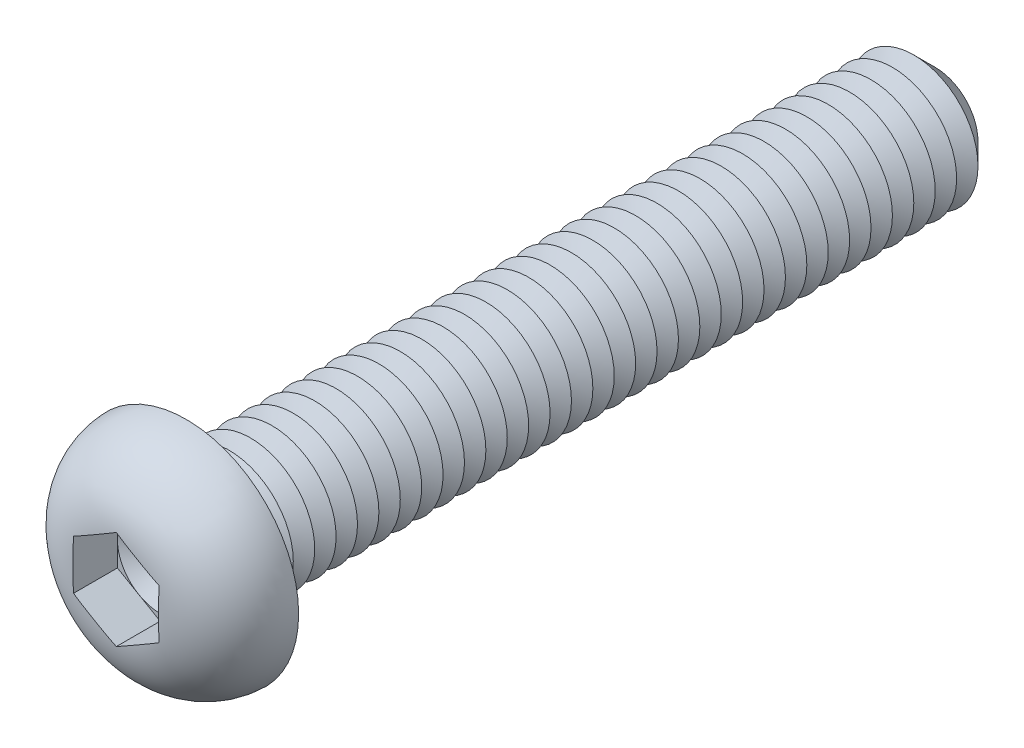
ISO-10303-21;
HEADER;
FILE_DESCRIPTION(('STEP AP214'),'2;1');
FILE_NAME('part.step','',(''),(''),'','','');
FILE_SCHEMA(('AUTOMOTIVE_DESIGN { 1 0 10303 214 1 1 1 1 }'));
ENDSEC;
DATA;
#1=APPLICATION_CONTEXT('core data for automotive mechanical design processes');
#2=APPLICATION_PROTOCOL_DEFINITION('international standard','automotive_design',2000,#1);
#3=PRODUCT_CONTEXT('',#1,'mechanical');
#4=PRODUCT('Part','Part','',(#3));
#5=PRODUCT_RELATED_PRODUCT_CATEGORY('part','',(#4));
#6=PRODUCT_DEFINITION_FORMATION('','',#4);
#7=PRODUCT_DEFINITION_CONTEXT('part definition',#1,'design');
#8=PRODUCT_DEFINITION('design','',#6,#7);
#9=PRODUCT_DEFINITION_SHAPE('','',#8);
#10=(LENGTH_UNIT() NAMED_UNIT(*) SI_UNIT(.MILLI.,.METRE.));
#11=(NAMED_UNIT(*) PLANE_ANGLE_UNIT() SI_UNIT($,.RADIAN.));
#12=(NAMED_UNIT(*) SI_UNIT($,.STERADIAN.) SOLID_ANGLE_UNIT());
#13=UNCERTAINTY_MEASURE_WITH_UNIT(LENGTH_MEASURE(1.E-05),#10,'distance_accuracy_value','');
#14=(GEOMETRIC_REPRESENTATION_CONTEXT(3) GLOBAL_UNCERTAINTY_ASSIGNED_CONTEXT((#13)) GLOBAL_UNIT_ASSIGNED_CONTEXT((#10,
#11,#12)) REPRESENTATION_CONTEXT('',''));
#15=CARTESIAN_POINT('',(0.,0.,0.));
#16=DIRECTION('',(0.,0.,1.));
#17=DIRECTION('',(1.,0.,0.));
#18=AXIS2_PLACEMENT_3D('',#15,#16,#17);
#19=CARTESIAN_POINT('',(0.,0.,1.22));
#20=DIRECTION('',(0.,0.,1.));
#21=DIRECTION('',(1.,0.,0.));
#22=AXIS2_PLACEMENT_3D('',#19,#20,#21);
#23=PLANE('',#22);
#24=CARTESIAN_POINT('',(0.,0.,1.22));
#25=DIRECTION('',(0.,0.,1.));
#26=DIRECTION('',(1.,0.,0.));
#27=AXIS2_PLACEMENT_3D('',#24,#25,#26);
#28=CIRCLE('',#27,2.);
#29=CARTESIAN_POINT('',(2.,0.,1.22));
#30=VERTEX_POINT('',#29);
#31=CARTESIAN_POINT('',(1.,1.73205080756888,1.22));
#32=VERTEX_POINT('',#31);
#33=EDGE_CURVE('E117',#30,#32,#28,.T.);
#34=ORIENTED_EDGE('',*,*,#33,.F.);
#35=DIRECTION('',(0.,1.,0.));
#36=VECTOR('',#35,1.);
#37=CARTESIAN_POINT('',(2.,-1.15470053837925,1.22));
#38=LINE('',#37,#36);
#39=CARTESIAN_POINT('',(2.,1.15470053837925,1.22));
#40=VERTEX_POINT('',#39);
#41=EDGE_CURVE('E140',#30,#40,#38,.T.);
#42=ORIENTED_EDGE('',*,*,#41,.T.);
#43=DIRECTION('',(-0.866025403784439,0.5,0.));
#44=VECTOR('',#43,1.);
#45=CARTESIAN_POINT('',(2.,1.15470053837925,1.22));
#46=LINE('',#45,#44);
#47=EDGE_CURVE('E136',#40,#32,#46,.T.);
#48=ORIENTED_EDGE('',*,*,#47,.T.);
#49=EDGE_LOOP('',(#34,#42,#48));
#50=FACE_BOUND('',#49,.T.);
#51=ADVANCED_FACE('F39',(#50),#23,.T.);
#52=CARTESIAN_POINT('',(0.,0.,1.22));
#53=DIRECTION('',(0.,0.,1.));
#54=DIRECTION('',(1.,0.,0.));
#55=AXIS2_PLACEMENT_3D('',#52,#53,#54);
#56=CIRCLE('',#55,2.);
#57=CARTESIAN_POINT('',(-1.,1.73205080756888,1.22));
#58=VERTEX_POINT('',#57);
#59=EDGE_CURVE('E11',#32,#58,#56,.T.);
#60=ORIENTED_EDGE('',*,*,#59,.F.);
#61=CARTESIAN_POINT('',(0.,2.3094010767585,1.22));
#62=VERTEX_POINT('',#61);
#63=EDGE_CURVE('E130',#32,#62,#46,.T.);
#64=ORIENTED_EDGE('',*,*,#63,.T.);
#65=DIRECTION('',(-0.866025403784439,-0.5,0.));
#66=VECTOR('',#65,1.);
#67=CARTESIAN_POINT('',(0.,2.3094010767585,1.22));
#68=LINE('',#67,#66);
#69=EDGE_CURVE('E131',#62,#58,#68,.T.);
#70=ORIENTED_EDGE('',*,*,#69,.T.);
#71=EDGE_LOOP('',(#60,#64,#70));
#72=FACE_BOUND('',#71,.T.);
#73=ADVANCED_FACE('F129',(#72),#23,.T.);
#74=CARTESIAN_POINT('',(-2.,0.,1.22));
#75=VERTEX_POINT('',#74);
#76=EDGE_CURVE('E49',#58,#75,#56,.T.);
#77=ORIENTED_EDGE('',*,*,#76,.F.);
#78=CARTESIAN_POINT('',(-2.,1.15470053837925,1.22));
#79=VERTEX_POINT('',#78);
#80=EDGE_CURVE('E143',#58,#79,#68,.T.);
#81=ORIENTED_EDGE('',*,*,#80,.T.);
#82=DIRECTION('',(0.,-1.,0.));
#83=VECTOR('',#82,1.);
#84=CARTESIAN_POINT('',(-2.,1.15470053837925,1.22));
#85=LINE('',#84,#83);
#86=EDGE_CURVE('E153',#79,#75,#85,.T.);
#87=ORIENTED_EDGE('',*,*,#86,.T.);
#88=EDGE_LOOP('',(#77,#81,#87));
#89=FACE_BOUND('',#88,.T.);
#90=ADVANCED_FACE('F272',(#89),#23,.T.);
#91=CARTESIAN_POINT('',(-1.,-1.73205080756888,1.22));
#92=VERTEX_POINT('',#91);
#93=EDGE_CURVE('E254',#75,#92,#56,.T.);
#94=ORIENTED_EDGE('',*,*,#93,.F.);
#95=CARTESIAN_POINT('',(-2.,-1.15470053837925,1.22));
#96=VERTEX_POINT('',#95);
#97=EDGE_CURVE('E152',#75,#96,#85,.T.);
#98=ORIENTED_EDGE('',*,*,#97,.T.);
#99=DIRECTION('',(0.866025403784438,-0.5,0.));
#100=VECTOR('',#99,1.);
#101=CARTESIAN_POINT('',(-2.,-1.15470053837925,1.22));
#102=LINE('',#101,#100);
#103=EDGE_CURVE('E158',#96,#92,#102,.T.);
#104=ORIENTED_EDGE('',*,*,#103,.T.);
#105=EDGE_LOOP('',(#94,#98,#104));
#106=FACE_BOUND('',#105,.T.);
#107=ADVANCED_FACE('F266',(#106),#23,.T.);
#108=CARTESIAN_POINT('',(0.999999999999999,-1.73205080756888,1.22));
#109=VERTEX_POINT('',#108);
#110=EDGE_CURVE('E56',#92,#109,#56,.T.);
#111=ORIENTED_EDGE('',*,*,#110,.F.);
#112=CARTESIAN_POINT('',(0.,-2.3094010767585,1.22));
#113=VERTEX_POINT('',#112);
#114=EDGE_CURVE('E157',#92,#113,#102,.T.);
#115=ORIENTED_EDGE('',*,*,#114,.T.);
#116=DIRECTION('',(0.866025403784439,0.5,0.));
#117=VECTOR('',#116,1.);
#118=CARTESIAN_POINT('',(0.,-2.3094010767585,1.22));
#119=LINE('',#118,#117);
#120=EDGE_CURVE('E163',#113,#109,#119,.T.);
#121=ORIENTED_EDGE('',*,*,#120,.T.);
#122=EDGE_LOOP('',(#111,#115,#121));
#123=FACE_BOUND('',#122,.T.);
#124=ADVANCED_FACE('F308',(#123),#23,.T.);
#125=CARTESIAN_POINT('',(0.,0.,-35.));
#126=DIRECTION('',(0.,0.,1.));
#127=DIRECTION('',(1.,0.,0.));
#128=AXIS2_PLACEMENT_3D('',#125,#126,#127);
#129=CYLINDRICAL_SURFACE('',#128,3.);
#130=CARTESIAN_POINT('',(0.,0.,-0.5));
#131=DIRECTION('',(0.,0.,1.));
#132=DIRECTION('',(1.,0.,0.));
#133=AXIS2_PLACEMENT_3D('',#130,#131,#132);
#134=CIRCLE('',#133,3.);
#135=CARTESIAN_POINT('',(3.,0.,-0.5));
#136=VERTEX_POINT('',#135);
#137=EDGE_CURVE('E241',#136,#136,#134,.F.);
#138=ORIENTED_EDGE('',*,*,#137,.T.);
#139=EDGE_LOOP('',(#138));
#140=FACE_BOUND('',#139,.T.);
#141=CARTESIAN_POINT('',(0.,0.,-1.));
#142=DIRECTION('',(0.,0.,1.));
#143=DIRECTION('',(1.,0.,0.));
#144=AXIS2_PLACEMENT_3D('',#141,#142,#143);
#145=CIRCLE('',#144,3.00000000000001);
#146=CARTESIAN_POINT('',(3.00000000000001,0.,-1.));
#147=VERTEX_POINT('',#146);
#148=EDGE_CURVE('E138',#147,#147,#145,.T.);
#149=ORIENTED_EDGE('',*,*,#148,.T.);
#150=EDGE_LOOP('',(#149));
#151=FACE_BOUND('',#150,.T.);
#152=ADVANCED_FACE('F309',(#140,#151),#129,.T.);
#153=CARTESIAN_POINT('',(0.,5.25,0.));
#154=DIRECTION('',(0.,0.,1.));
#155=DIRECTION('',(1.,0.,0.));
#156=AXIS2_PLACEMENT_3D('',#153,#154,#155);
#157=PLANE('',#156);
#158=CARTESIAN_POINT('',(0.,0.,0.));
#159=DIRECTION('',(0.,0.,1.));
#160=DIRECTION('',(1.,0.,0.));
#161=AXIS2_PLACEMENT_3D('',#158,#159,#160);
#162=CIRCLE('',#161,3.5);
#163=CARTESIAN_POINT('',(3.5,0.,0.));
#164=VERTEX_POINT('',#163);
#165=EDGE_CURVE('E244',#164,#164,#162,.T.);
#166=ORIENTED_EDGE('',*,*,#165,.T.);
#167=EDGE_LOOP('',(#166));
#168=FACE_BOUND('',#167,.T.);
#169=CARTESIAN_POINT('',(0.,0.,0.));
#170=DIRECTION('',(0.,0.,1.));
#171=DIRECTION('',(1.,0.,0.));
#172=AXIS2_PLACEMENT_3D('',#169,#170,#171);
#173=CIRCLE('',#172,5.25);
#174=CARTESIAN_POINT('',(5.25,0.,0.));
#175=VERTEX_POINT('',#174);
#176=EDGE_CURVE('E173',#175,#175,#173,.T.);
#177=ORIENTED_EDGE('',*,*,#176,.F.);
#178=EDGE_LOOP('',(#177));
#179=FACE_BOUND('',#178,.T.);
#180=ADVANCED_FACE('F312',(#168,#179),#157,.F.);
#181=CARTESIAN_POINT('',(0.,0.,-0.0999999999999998));
#182=DIRECTION('',(0.,0.,1.));
#183=DIRECTION('',(1.,0.,0.));
#184=AXIS2_PLACEMENT_3D('',#181,#182,#183);
#185=DEGENERATE_TOROIDAL_SURFACE('',#184,1.85147090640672,3.4,.T.);
#186=CARTESIAN_POINT('',(-2.0002,1.15458506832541,3.26900492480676));
#187=CARTESIAN_POINT('',(-1.91694658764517,1.20265144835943,3.27552708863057));
#188=CARTESIAN_POINT('',(-1.83362001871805,1.25076006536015,3.28041849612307));
#189=CARTESIAN_POINT('',(-1.66691146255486,1.34700929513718,3.28784569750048));
#190=CARTESIAN_POINT('',(-1.58352950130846,1.39514989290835,3.29038223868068));
#191=CARTESIAN_POINT('',(-1.4167967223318,1.49141310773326,3.29400753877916));
#192=CARTESIAN_POINT('',(-1.33344591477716,1.5395357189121,3.29509714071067));
#193=CARTESIAN_POINT('',(-1.16673007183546,1.63578915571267,3.29647051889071));
#194=CARTESIAN_POINT('',(-1.08336503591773,1.68391998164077,3.29675420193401));
#195=CARTESIAN_POINT('',(-0.916634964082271,1.78018163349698,3.29675420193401));
#196=CARTESIAN_POINT('',(-0.833269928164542,1.82831245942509,3.29647051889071));
#197=CARTESIAN_POINT('',(-0.666554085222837,1.92456589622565,3.29509714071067));
#198=CARTESIAN_POINT('',(-0.583203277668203,1.9726885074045,3.29400753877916));
#199=CARTESIAN_POINT('',(-0.416470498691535,2.06895172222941,3.29038223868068));
#200=CARTESIAN_POINT('',(-0.333088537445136,2.11709232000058,3.28784569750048));
#201=CARTESIAN_POINT('',(-0.166379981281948,2.21334154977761,3.28041849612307));
#202=CARTESIAN_POINT('',(-0.0830534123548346,2.26145016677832,3.27552708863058));
#203=CARTESIAN_POINT('',(0.000200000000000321,2.30951654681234,3.26900492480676));
#204=B_SPLINE_CURVE_WITH_KNOTS('',3,(#186,#187,#188,#189,#190,#191,#192,#193,#194,#195,#196,
#197,#198,#199,#200,#201,#202,#203),.UNSPECIFIED.,.F.,.F.,(4,2,2,2,2,2,2,2,4),(0.,
0.289010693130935,0.57792963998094,0.866680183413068,1.15546411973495,1.44424805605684,
1.73299859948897,2.02191754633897,2.31092823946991),.UNSPECIFIED.);
#205=CARTESIAN_POINT('',(-2.,1.15470053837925,3.26902062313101));
#206=VERTEX_POINT('',#205);
#207=CARTESIAN_POINT('',(1.70733705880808E-11,2.30940107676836,3.2690206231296));
#208=VERTEX_POINT('',#207);
#209=EDGE_CURVE('E195',#206,#208,#204,.T.);
#210=ORIENTED_EDGE('',*,*,#209,.T.);
#211=CARTESIAN_POINT('',(-0.000199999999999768,2.30951654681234,3.26900492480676));
#212=CARTESIAN_POINT('',(0.0830534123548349,2.26145016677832,3.27552708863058));
#213=CARTESIAN_POINT('',(0.166379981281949,2.21334154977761,3.28041849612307));
#214=CARTESIAN_POINT('',(0.333088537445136,2.11709232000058,3.28784569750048));
#215=CARTESIAN_POINT('',(0.416470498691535,2.06895172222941,3.29038223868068));
#216=CARTESIAN_POINT('',(0.583203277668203,1.9726885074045,3.29400753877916));
#217=CARTESIAN_POINT('',(0.666554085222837,1.92456589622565,3.29509714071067));
#218=CARTESIAN_POINT('',(0.833269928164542,1.82831245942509,3.29647051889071));
#219=CARTESIAN_POINT('',(0.916634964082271,1.78018163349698,3.29675420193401));
#220=CARTESIAN_POINT('',(1.08336503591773,1.68391998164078,3.29675420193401));
#221=CARTESIAN_POINT('',(1.16673007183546,1.63578915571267,3.29647051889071));
#222=CARTESIAN_POINT('',(1.33344591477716,1.5395357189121,3.29509714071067));
#223=CARTESIAN_POINT('',(1.4167967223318,1.49141310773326,3.29400753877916));
#224=CARTESIAN_POINT('',(1.58352950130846,1.39514989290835,3.29038223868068));
#225=CARTESIAN_POINT('',(1.66691146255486,1.34700929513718,3.28784569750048));
#226=CARTESIAN_POINT('',(1.83362001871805,1.25076006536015,3.28041849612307));
#227=CARTESIAN_POINT('',(1.91694658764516,1.20265144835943,3.27552708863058));
#228=CARTESIAN_POINT('',(2.0002,1.15458506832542,3.26900492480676));
#229=B_SPLINE_CURVE_WITH_KNOTS('',3,(#211,#212,#213,#214,#215,#216,#217,#218,#219,#220,#221,
#222,#223,#224,#225,#226,#227,#228),.UNSPECIFIED.,.F.,.F.,(4,2,2,2,2,2,2,2,4),(0.,
0.289010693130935,0.577929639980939,0.866680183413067,1.15546411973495,1.44424805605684,
1.73299859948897,2.02191754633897,2.31092823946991),.UNSPECIFIED.);
#230=CARTESIAN_POINT('',(2.,1.15470053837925,3.26902062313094));
#231=VERTEX_POINT('',#230);
#232=EDGE_CURVE('E224',#208,#231,#229,.T.);
#233=ORIENTED_EDGE('',*,*,#232,.T.);
#234=CARTESIAN_POINT('',(2.,0.,3.29675420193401));
#235=CARTESIAN_POINT('',(2.,-0.0838690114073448,3.29675159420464));
#236=CARTESIAN_POINT('',(2.,-0.167737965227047,3.29653427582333));
#237=CARTESIAN_POINT('',(2.,-0.335473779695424,3.29552217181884));
#238=CARTESIAN_POINT('',(2.,-0.419340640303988,3.29472737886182));
#239=CARTESIAN_POINT('',(2.,-0.587092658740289,3.29218243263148));
#240=CARTESIAN_POINT('',(2.,-0.670977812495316,3.29043194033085));
#241=CARTESIAN_POINT('',(2.,-0.838702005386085,3.28542814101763));
#242=CARTESIAN_POINT('',(2.,-0.922541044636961,3.28217483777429));
#243=CARTESIAN_POINT('',(2.,-1.173343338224,3.26923984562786));
#244=CARTESIAN_POINT('',(2.,-1.34017699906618,3.25638268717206));
#245=CARTESIAN_POINT('',(2.,-1.67225876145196,3.21731215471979));
#246=CARTESIAN_POINT('',(2.,-1.83750825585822,3.19111187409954));
#247=CARTESIAN_POINT('',(2.,-2.10571503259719,3.13417573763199));
#248=CARTESIAN_POINT('',(2.,-2.20973442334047,3.10844622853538));
#249=CARTESIAN_POINT('',(2.,-2.41562153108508,3.04936015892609));
#250=CARTESIAN_POINT('',(2.,-2.51748898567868,3.01600267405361));
#251=CARTESIAN_POINT('',(2.,-2.71832295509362,2.94120377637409));
#252=CARTESIAN_POINT('',(2.,-2.81728700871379,2.89975572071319));
#253=CARTESIAN_POINT('',(2.,-3.01134256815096,2.80859624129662));
#254=CARTESIAN_POINT('',(2.,-3.10643425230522,2.75888519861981));
#255=CARTESIAN_POINT('',(2.,-3.29253530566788,2.65079509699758));
#256=CARTESIAN_POINT('',(2.,-3.38350832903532,2.59235327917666));
#257=CARTESIAN_POINT('',(2.,-3.55964478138,2.46728791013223));
#258=CARTESIAN_POINT('',(2.,-3.64480873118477,2.40066509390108));
#259=CARTESIAN_POINT('',(2.,-3.80840353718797,2.25961603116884));
#260=CARTESIAN_POINT('',(2.,-3.88683504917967,2.18519054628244));
#261=CARTESIAN_POINT('',(2.,-4.03608847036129,2.02906828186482));
#262=CARTESIAN_POINT('',(2.,-4.106911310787,1.94737239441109));
#263=CARTESIAN_POINT('',(2.,-4.23287471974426,1.78665318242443));
#264=CARTESIAN_POINT('',(2.,-4.2888832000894,1.7083085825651));
#265=CARTESIAN_POINT('',(2.,-4.39372062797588,1.54691061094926));
#266=CARTESIAN_POINT('',(2.,-4.44254705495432,1.46385560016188));
#267=CARTESIAN_POINT('',(2.,-4.53249771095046,1.29375158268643));
#268=CARTESIAN_POINT('',(2.,-4.57362814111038,1.20670586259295));
#269=CARTESIAN_POINT('',(2.,-4.6478549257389,1.02924414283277));
#270=CARTESIAN_POINT('',(2.,-4.68094842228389,0.938826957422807));
#271=CARTESIAN_POINT('',(2.,-4.76413649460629,0.674747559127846));
#272=CARTESIAN_POINT('',(2.,-4.80368573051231,0.497625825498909));
#273=CARTESIAN_POINT('',(2.,-4.85179982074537,0.13932226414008));
#274=CARTESIAN_POINT('',(2.,-4.86036774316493,-0.0418591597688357));
#275=CARTESIAN_POINT('',(2.,-4.84642577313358,-0.399473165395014));
#276=CARTESIAN_POINT('',(2.,-4.82452156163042,-0.575929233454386));
#277=CARTESIAN_POINT('',(2.,-4.75142809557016,-0.922615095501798));
#278=CARTESIAN_POINT('',(2.,-4.70024536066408,-1.09284626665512));
#279=CARTESIAN_POINT('',(2.,-4.57020203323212,-1.42258491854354));
#280=CARTESIAN_POINT('',(2.,-4.49131097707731,-1.58208036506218));
#281=CARTESIAN_POINT('',(2.,-4.3083542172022,-1.8860021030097));
#282=CARTESIAN_POINT('',(2.,-4.2042742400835,-2.03041978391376));
#283=CARTESIAN_POINT('',(2.,-3.97174533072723,-2.30354399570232));
#284=CARTESIAN_POINT('',(2.,-3.84281347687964,-2.43183812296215));
#285=CARTESIAN_POINT('',(2.,-3.56631740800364,-2.66612298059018));
#286=CARTESIAN_POINT('',(2.,-3.41877418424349,-2.77213848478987));
#287=CARTESIAN_POINT('',(2.,-3.18261597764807,-2.91604941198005));
#288=CARTESIAN_POINT('',(2.,-3.09905663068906,-2.96247915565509));
#289=CARTESIAN_POINT('',(2.,-2.92856838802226,-3.04879370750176));
#290=CARTESIAN_POINT('',(2.,-2.84163827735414,-3.08867612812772));
#291=CARTESIAN_POINT('',(2.,-2.66495003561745,-3.16199567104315));
#292=CARTESIAN_POINT('',(2.,-2.57518752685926,-3.19542218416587));
#293=CARTESIAN_POINT('',(2.,-2.3936698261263,-3.25594506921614));
#294=CARTESIAN_POINT('',(2.,-2.30191676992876,-3.28304789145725));
#295=CARTESIAN_POINT('',(2.,-2.07265810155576,-3.34285611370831));
#296=CARTESIAN_POINT('',(2.,-1.93423373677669,-3.37205334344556));
#297=CARTESIAN_POINT('',(2.,-1.65546420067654,-3.419280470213));
#298=CARTESIAN_POINT('',(2.,-1.51511762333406,-3.43730169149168));
#299=CARTESIAN_POINT('',(2.,-1.23291689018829,-3.46473877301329));
#300=CARTESIAN_POINT('',(2.,-1.09105869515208,-3.47411015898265));
#301=CARTESIAN_POINT('',(2.,-0.807138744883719,-3.48717303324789));
#302=CARTESIAN_POINT('',(2.,-0.665077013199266,-3.4908651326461));
#303=CARTESIAN_POINT('',(2.,-0.451303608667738,-3.49429675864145));
#304=CARTESIAN_POINT('',(2.,-0.379602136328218,-3.49508825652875));
#305=CARTESIAN_POINT('',(2.,-0.236195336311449,-3.49619580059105));
#306=CARTESIAN_POINT('',(2.,-0.164490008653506,-3.49651184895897));
#307=CARTESIAN_POINT('',(2.,-0.0210718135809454,-3.49680708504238));
#308=CARTESIAN_POINT('',(2.,0.0506410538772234,-3.49678623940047));
#309=CARTESIAN_POINT('',(2.,0.194065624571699,-3.49639104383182));
#310=CARTESIAN_POINT('',(2.,0.265777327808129,-3.49601669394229));
#311=CARTESIAN_POINT('',(2.,0.480501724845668,-3.4941697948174));
#312=CARTESIAN_POINT('',(2.,0.623510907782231,-3.49197539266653));
#313=CARTESIAN_POINT('',(2.,0.909378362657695,-3.48318258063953));
#314=CARTESIAN_POINT('',(2.,1.05223667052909,-3.47658576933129));
#315=CARTESIAN_POINT('',(2.,1.30726724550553,-3.45800282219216));
#316=CARTESIAN_POINT('',(2.,1.41953767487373,-3.44745204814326));
#317=CARTESIAN_POINT('',(2.,1.64336701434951,-3.42020385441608));
#318=CARTESIAN_POINT('',(2.,1.75492585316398,-3.40350582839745));
#319=CARTESIAN_POINT('',(2.,1.97590795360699,-3.36293007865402));
#320=CARTESIAN_POINT('',(2.,2.08534088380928,-3.33910600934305));
#321=CARTESIAN_POINT('',(2.,2.30216001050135,-3.28336687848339));
#322=CARTESIAN_POINT('',(2.,2.40954602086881,-3.25145108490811));
#323=CARTESIAN_POINT('',(2.,2.62289868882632,-3.1784271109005));
#324=CARTESIAN_POINT('',(2.,2.72882262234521,-3.13719314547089));
#325=CARTESIAN_POINT('',(2.,2.93660837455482,-3.04548652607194));
#326=CARTESIAN_POINT('',(2.,3.03847031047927,-2.99501413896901));
#327=CARTESIAN_POINT('',(2.,3.23738754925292,-2.88459171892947));
#328=CARTESIAN_POINT('',(2.,3.33442546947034,-2.82461027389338));
#329=CARTESIAN_POINT('',(2.,3.52225616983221,-2.69545434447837));
#330=CARTESIAN_POINT('',(2.,3.61304636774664,-2.62627609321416));
#331=CARTESIAN_POINT('',(2.,3.77958578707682,-2.48563135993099));
#332=CARTESIAN_POINT('',(2.,3.85595570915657,-2.41489922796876));
#333=CARTESIAN_POINT('',(2.,4.00175744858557,-2.26661746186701));
#334=CARTESIAN_POINT('',(2.,4.07118992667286,-2.18906847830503));
#335=CARTESIAN_POINT('',(2.,4.20228235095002,-2.02784942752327));
#336=CARTESIAN_POINT('',(2.,4.26395450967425,-1.94418931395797));
#337=CARTESIAN_POINT('',(2.,4.37897455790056,-1.7713710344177));
#338=CARTESIAN_POINT('',(2.,4.43232318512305,-1.68221335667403));
#339=CARTESIAN_POINT('',(2.,4.5685109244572,-1.42722170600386));
#340=CARTESIAN_POINT('',(2.,4.64167742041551,-1.25607726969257));
#341=CARTESIAN_POINT('',(2.,4.75695354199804,-0.903699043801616));
#342=CARTESIAN_POINT('',(2.,4.79906366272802,-0.722465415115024));
#343=CARTESIAN_POINT('',(2.,4.84982785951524,-0.362243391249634));
#344=CARTESIAN_POINT('',(2.,4.85966759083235,-0.183422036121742));
#345=CARTESIAN_POINT('',(2.,4.84889099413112,0.17327689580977));
#346=CARTESIAN_POINT('',(2.,4.82827907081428,0.351154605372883));
#347=CARTESIAN_POINT('',(2.,4.75760776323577,0.699332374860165));
#348=CARTESIAN_POINT('',(2.,4.70780624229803,0.869684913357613));
#349=CARTESIAN_POINT('',(2.,4.58058971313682,1.199716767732));
#350=CARTESIAN_POINT('',(2.,4.50317623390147,1.35939667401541));
#351=CARTESIAN_POINT('',(2.,4.32230037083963,1.66542907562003));
#352=CARTESIAN_POINT('',(2.,4.21858077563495,1.81162931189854));
#353=CARTESIAN_POINT('',(2.,3.98879583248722,2.08527000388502));
#354=CARTESIAN_POINT('',(2.,3.86272429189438,2.21270524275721));
#355=CARTESIAN_POINT('',(2.,3.58743550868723,2.45020985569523));
#356=CARTESIAN_POINT('',(2.,3.43756474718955,2.55951924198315));
#357=CARTESIAN_POINT('',(2.,3.12282273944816,2.7535430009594));
#358=CARTESIAN_POINT('',(2.,2.95795742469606,2.83826704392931));
#359=CARTESIAN_POINT('',(2.,2.67096435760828,2.96064273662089));
#360=CARTESIAN_POINT('',(2.,2.55150855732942,3.00473766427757));
#361=CARTESIAN_POINT('',(2.,2.30905936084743,3.08191633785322));
#362=CARTESIAN_POINT('',(2.,2.18606487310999,3.11499664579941));
#363=CARTESIAN_POINT('',(2.,1.93761764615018,3.17114962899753));
#364=CARTESIAN_POINT('',(2.,1.8121607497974,3.19420352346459));
#365=CARTESIAN_POINT('',(2.,1.56000755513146,3.23170431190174));
#366=CARTESIAN_POINT('',(2.,1.43331126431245,3.24615125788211));
#367=CARTESIAN_POINT('',(2.,1.19785080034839,3.26676473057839));
#368=CARTESIAN_POINT('',(2.,1.08915974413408,3.27383022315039));
#369=CARTESIAN_POINT('',(2.,0.87159878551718,3.28448481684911));
#370=CARTESIAN_POINT('',(2.,0.762728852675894,3.28807324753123));
#371=CARTESIAN_POINT('',(2.,0.54488171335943,3.29312180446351));
#372=CARTESIAN_POINT('',(2.,0.435904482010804,3.29458062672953));
#373=CARTESIAN_POINT('',(2.,0.217951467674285,3.29639847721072));
#374=CARTESIAN_POINT('',(2.,0.108975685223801,3.29675759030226));
#375=CARTESIAN_POINT('',(2.,0.,3.29675420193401));
#376=B_SPLINE_CURVE_WITH_KNOTS('',3,(#234,#235,#236,#237,#238,#239,#240,#241,#242,#243,#244,
#245,#246,#247,#248,#249,#250,#251,#252,#253,#254,#255,#256,#257,#258,#259,#260,#261,#262,#263,
#264,#265,#266,#267,#268,#269,#270,#271,#272,#273,#274,#275,#276,#277,#278,#279,#280,#281,#282,
#283,#284,#285,#286,#287,#288,#289,#290,#291,#292,#293,#294,#295,#296,#297,#298,#299,#300,#301,
#302,#303,#304,#305,#306,#307,#308,#309,#310,#311,#312,#313,#314,#315,#316,#317,#318,#319,#320,
#321,#322,#323,#324,#325,#326,#327,#328,#329,#330,#331,#332,#333,#334,#335,#336,#337,#338,#339,
#340,#341,#342,#343,#344,#345,#346,#347,#348,#349,#350,#351,#352,#353,#354,#355,#356,#357,#358,
#359,#360,#361,#362,#363,#364,#365,#366,#367,#368,#369,#370,#371,#372,#373,#374,#375),
.UNSPECIFIED.,.T.,.F.,(4,2,2,2,2,2,2,2,2,2,2,2,2,2,2,2,2,2,2,2,2,2,2,2,2,2,2,2,2,2,2,2,2,2,2,2,
2,2,2,2,2,2,2,2,2,2,2,2,2,2,2,2,2,2,2,2,2,2,2,2,2,2,2,2,2,2,2,2,2,2,4),(0.,0.251606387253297,
0.503215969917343,0.754914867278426,1.00661313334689,1.50825543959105,2.00940643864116,
2.33061510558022,2.65186271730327,2.97337521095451,3.29487288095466,3.61880390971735,
3.94270585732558,4.26657621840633,4.59040689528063,4.8789527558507,5.16759964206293,
5.45601293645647,5.74452864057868,6.28608750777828,6.82759274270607,7.35848716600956,
7.8892634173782,8.42062506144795,8.95228851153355,9.49557283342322,10.0382497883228,
10.3247866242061,10.6114277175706,10.8985359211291,11.1853499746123,11.6091713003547,
12.0333212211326,12.4596400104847,12.8859129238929,13.1010304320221,13.316146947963,
13.5312847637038,13.746422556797,14.1754765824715,14.6043748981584,14.9425387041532,
15.2807358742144,15.6164481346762,15.9521907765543,16.2927694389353,16.6333382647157,
16.9750565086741,17.3169151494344,17.6287548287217,17.9405647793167,18.2518777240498,
18.5631630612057,19.1185081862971,19.6738444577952,20.20853386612,20.7431459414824,
21.2731049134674,21.8030345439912,22.3383600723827,22.8738341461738,23.4279697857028,
23.9818871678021,24.3633752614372,24.7449823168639,25.1273011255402,25.5096176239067,
25.8363061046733,26.163057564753,26.4900090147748,26.8169352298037),.UNSPECIFIED.);
#377=CARTESIAN_POINT('',(2.,-1.15470053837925,3.26902062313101));
#378=VERTEX_POINT('',#377);
#379=EDGE_CURVE('E233',#231,#378,#376,.T.);
#380=ORIENTED_EDGE('',*,*,#379,.T.);
#381=CARTESIAN_POINT('',(2.0002,-1.15458506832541,3.26900492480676));
#382=CARTESIAN_POINT('',(1.91694658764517,-1.20265144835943,3.27552708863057));
#383=CARTESIAN_POINT('',(1.83362001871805,-1.25076006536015,3.28041849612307));
#384=CARTESIAN_POINT('',(1.66691146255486,-1.34700929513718,3.28784569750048));
#385=CARTESIAN_POINT('',(1.58352950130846,-1.39514989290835,3.29038223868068));
#386=CARTESIAN_POINT('',(1.4167967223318,-1.49141310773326,3.29400753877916));
#387=CARTESIAN_POINT('',(1.33344591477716,-1.5395357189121,3.29509714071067));
#388=CARTESIAN_POINT('',(1.16673007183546,-1.63578915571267,3.29647051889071));
#389=CARTESIAN_POINT('',(1.08336503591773,-1.68391998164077,3.29675420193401));
#390=CARTESIAN_POINT('',(0.916634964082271,-1.78018163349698,3.29675420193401));
#391=CARTESIAN_POINT('',(0.833269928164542,-1.82831245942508,3.29647051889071));
#392=CARTESIAN_POINT('',(0.666554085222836,-1.92456589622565,3.29509714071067));
#393=CARTESIAN_POINT('',(0.583203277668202,-1.97268850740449,3.29400753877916));
#394=CARTESIAN_POINT('',(0.416470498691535,-2.06895172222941,3.29038223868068));
#395=CARTESIAN_POINT('',(0.333088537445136,-2.11709232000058,3.28784569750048));
#396=CARTESIAN_POINT('',(0.166379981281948,-2.2133415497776,3.28041849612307));
#397=CARTESIAN_POINT('',(0.0830534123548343,-2.26145016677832,3.27552708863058));
#398=CARTESIAN_POINT('',(-0.000200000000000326,-2.30951654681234,3.26900492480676));
#399=B_SPLINE_CURVE_WITH_KNOTS('',3,(#381,#382,#383,#384,#385,#386,#387,#388,#389,#390,#391,
#392,#393,#394,#395,#396,#397,#398),.UNSPECIFIED.,.F.,.F.,(4,2,2,2,2,2,2,2,4),(0.,
0.289010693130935,0.57792963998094,0.866680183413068,1.15546411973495,1.44424805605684,
1.73299859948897,2.02191754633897,2.31092823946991),.UNSPECIFIED.);
#400=CARTESIAN_POINT('',(0.,-2.3094010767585,3.26902062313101));
#401=VERTEX_POINT('',#400);
#402=EDGE_CURVE('E283',#378,#401,#399,.T.);
#403=ORIENTED_EDGE('',*,*,#402,.T.);
#404=CARTESIAN_POINT('',(0.000199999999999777,-2.30951654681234,3.26900492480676));
#405=CARTESIAN_POINT('',(-0.083053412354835,-2.26145016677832,3.27552708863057));
#406=CARTESIAN_POINT('',(-0.166379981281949,-2.21334154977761,3.28041849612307));
#407=CARTESIAN_POINT('',(-0.333088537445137,-2.11709232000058,3.28784569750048));
#408=CARTESIAN_POINT('',(-0.416470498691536,-2.06895172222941,3.29038223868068));
#409=CARTESIAN_POINT('',(-0.583203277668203,-1.97268850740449,3.29400753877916));
#410=CARTESIAN_POINT('',(-0.666554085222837,-1.92456589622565,3.29509714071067));
#411=CARTESIAN_POINT('',(-0.833269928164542,-1.82831245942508,3.29647051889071));
#412=CARTESIAN_POINT('',(-0.916634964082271,-1.78018163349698,3.29675420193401));
#413=CARTESIAN_POINT('',(-1.08336503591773,-1.68391998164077,3.29675420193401));
#414=CARTESIAN_POINT('',(-1.16673007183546,-1.63578915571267,3.29647051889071));
#415=CARTESIAN_POINT('',(-1.33344591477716,-1.5395357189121,3.29509714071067));
#416=CARTESIAN_POINT('',(-1.4167967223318,-1.49141310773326,3.29400753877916));
#417=CARTESIAN_POINT('',(-1.58352950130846,-1.39514989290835,3.29038223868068));
#418=CARTESIAN_POINT('',(-1.66691146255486,-1.34700929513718,3.28784569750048));
#419=CARTESIAN_POINT('',(-1.83362001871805,-1.25076006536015,3.28041849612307));
#420=CARTESIAN_POINT('',(-1.91694658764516,-1.20265144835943,3.27552708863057));
#421=CARTESIAN_POINT('',(-2.0002,-1.15458506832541,3.26900492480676));
#422=B_SPLINE_CURVE_WITH_KNOTS('',3,(#404,#405,#406,#407,#408,#409,#410,#411,#412,#413,#414,
#415,#416,#417,#418,#419,#420,#421),.UNSPECIFIED.,.F.,.F.,(4,2,2,2,2,2,2,2,4),(0.,
0.289010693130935,0.577929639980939,0.866680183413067,1.15546411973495,1.44424805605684,
1.73299859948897,2.02191754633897,2.31092823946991),.UNSPECIFIED.);
#423=CARTESIAN_POINT('',(-2.,-1.15470053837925,3.26902062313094));
#424=VERTEX_POINT('',#423);
#425=EDGE_CURVE('E279',#401,#424,#422,.T.);
#426=ORIENTED_EDGE('',*,*,#425,.T.);
#427=CARTESIAN_POINT('',(-2.,0.,3.29675420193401));
#428=CARTESIAN_POINT('',(-2.,0.0838690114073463,3.29675159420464));
#429=CARTESIAN_POINT('',(-2.,0.167737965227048,3.29653427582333));
#430=CARTESIAN_POINT('',(-2.,0.335473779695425,3.29552217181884));
#431=CARTESIAN_POINT('',(-2.,0.41934064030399,3.29472737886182));
#432=CARTESIAN_POINT('',(-2.,0.58709265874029,3.29218243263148));
#433=CARTESIAN_POINT('',(-2.,0.670977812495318,3.29043194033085));
#434=CARTESIAN_POINT('',(-2.,0.838702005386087,3.28542814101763));
#435=CARTESIAN_POINT('',(-2.,0.922541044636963,3.28217483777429));
#436=CARTESIAN_POINT('',(-2.,1.173343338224,3.26923984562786));
#437=CARTESIAN_POINT('',(-2.,1.34017699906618,3.25638268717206));
#438=CARTESIAN_POINT('',(-2.,1.67225876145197,3.21731215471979));
#439=CARTESIAN_POINT('',(-2.,1.83750825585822,3.19111187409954));
#440=CARTESIAN_POINT('',(-2.,2.10571503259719,3.13417573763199));
#441=CARTESIAN_POINT('',(-2.,2.20973442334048,3.10844622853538));
#442=CARTESIAN_POINT('',(-2.,2.41562153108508,3.04936015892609));
#443=CARTESIAN_POINT('',(-2.,2.51748898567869,3.01600267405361));
#444=CARTESIAN_POINT('',(-2.,2.71832295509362,2.94120377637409));
#445=CARTESIAN_POINT('',(-2.,2.81728700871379,2.89975572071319));
#446=CARTESIAN_POINT('',(-2.,3.01134256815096,2.80859624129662));
#447=CARTESIAN_POINT('',(-2.,3.10643425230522,2.75888519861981));
#448=CARTESIAN_POINT('',(-2.,3.29253530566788,2.65079509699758));
#449=CARTESIAN_POINT('',(-2.,3.38350832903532,2.59235327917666));
#450=CARTESIAN_POINT('',(-2.,3.55964478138,2.46728791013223));
#451=CARTESIAN_POINT('',(-2.,3.64480873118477,2.40066509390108));
#452=CARTESIAN_POINT('',(-2.,3.80840353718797,2.25961603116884));
#453=CARTESIAN_POINT('',(-2.,3.88683504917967,2.18519054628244));
#454=CARTESIAN_POINT('',(-2.,4.03608847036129,2.02906828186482));
#455=CARTESIAN_POINT('',(-2.,4.106911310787,1.94737239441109));
#456=CARTESIAN_POINT('',(-2.,4.23287471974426,1.78665318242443));
#457=CARTESIAN_POINT('',(-2.,4.2888832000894,1.7083085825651));
#458=CARTESIAN_POINT('',(-2.,4.39372062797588,1.54691061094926));
#459=CARTESIAN_POINT('',(-2.,4.44254705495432,1.46385560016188));
#460=CARTESIAN_POINT('',(-2.,4.53249771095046,1.29375158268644));
#461=CARTESIAN_POINT('',(-2.,4.57362814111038,1.20670586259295));
#462=CARTESIAN_POINT('',(-2.,4.6478549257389,1.02924414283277));
#463=CARTESIAN_POINT('',(-2.,4.68094842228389,0.938826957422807));
#464=CARTESIAN_POINT('',(-2.,4.76413649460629,0.674747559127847));
#465=CARTESIAN_POINT('',(-2.,4.80368573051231,0.497625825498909));
#466=CARTESIAN_POINT('',(-2.,4.85179982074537,0.13932226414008));
#467=CARTESIAN_POINT('',(-2.,4.86036774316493,-0.0418591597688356));
#468=CARTESIAN_POINT('',(-2.,4.84642577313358,-0.399473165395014));
#469=CARTESIAN_POINT('',(-2.,4.82452156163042,-0.575929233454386));
#470=CARTESIAN_POINT('',(-2.,4.75142809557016,-0.922615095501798));
#471=CARTESIAN_POINT('',(-2.,4.70024536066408,-1.09284626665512));
#472=CARTESIAN_POINT('',(-2.,4.57020203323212,-1.42258491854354));
#473=CARTESIAN_POINT('',(-2.,4.49131097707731,-1.58208036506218));
#474=CARTESIAN_POINT('',(-2.,4.3083542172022,-1.8860021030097));
#475=CARTESIAN_POINT('',(-2.,4.2042742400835,-2.03041978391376));
#476=CARTESIAN_POINT('',(-2.,3.97174533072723,-2.30354399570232));
#477=CARTESIAN_POINT('',(-2.,3.84281347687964,-2.43183812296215));
#478=CARTESIAN_POINT('',(-2.,3.56631740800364,-2.66612298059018));
#479=CARTESIAN_POINT('',(-2.,3.41877418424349,-2.77213848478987));
#480=CARTESIAN_POINT('',(-2.,3.18261597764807,-2.91604941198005));
#481=CARTESIAN_POINT('',(-2.,3.09905663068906,-2.96247915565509));
#482=CARTESIAN_POINT('',(-2.,2.92856838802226,-3.04879370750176));
#483=CARTESIAN_POINT('',(-2.,2.84163827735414,-3.08867612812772));
#484=CARTESIAN_POINT('',(-2.,2.66495003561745,-3.16199567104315));
#485=CARTESIAN_POINT('',(-2.,2.57518752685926,-3.19542218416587));
#486=CARTESIAN_POINT('',(-2.,2.3936698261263,-3.25594506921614));
#487=CARTESIAN_POINT('',(-2.,2.30191676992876,-3.28304789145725));
#488=CARTESIAN_POINT('',(-2.,2.07265810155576,-3.34285611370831));
#489=CARTESIAN_POINT('',(-2.,1.93423373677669,-3.37205334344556));
#490=CARTESIAN_POINT('',(-2.,1.65546420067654,-3.419280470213));
#491=CARTESIAN_POINT('',(-2.,1.51511762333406,-3.43730169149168));
#492=CARTESIAN_POINT('',(-2.,1.23291689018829,-3.46473877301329));
#493=CARTESIAN_POINT('',(-2.,1.09105869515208,-3.47411015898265));
#494=CARTESIAN_POINT('',(-2.,0.807138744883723,-3.48717303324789));
#495=CARTESIAN_POINT('',(-2.,0.66507701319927,-3.4908651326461));
#496=CARTESIAN_POINT('',(-2.,0.451303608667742,-3.49429675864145));
#497=CARTESIAN_POINT('',(-2.,0.379602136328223,-3.49508825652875));
#498=CARTESIAN_POINT('',(-2.,0.236195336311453,-3.49619580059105));
#499=CARTESIAN_POINT('',(-2.,0.16449000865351,-3.49651184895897));
#500=CARTESIAN_POINT('',(-2.,0.0210718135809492,-3.49680708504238));
#501=CARTESIAN_POINT('',(-2.,-0.0506410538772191,-3.49678623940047));
#502=CARTESIAN_POINT('',(-2.,-0.194065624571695,-3.49639104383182));
#503=CARTESIAN_POINT('',(-2.,-0.265777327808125,-3.49601669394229));
#504=CARTESIAN_POINT('',(-2.,-0.480501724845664,-3.4941697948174));
#505=CARTESIAN_POINT('',(-2.,-0.623510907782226,-3.49197539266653));
#506=CARTESIAN_POINT('',(-2.,-0.909378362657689,-3.48318258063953));
#507=CARTESIAN_POINT('',(-2.,-1.05223667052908,-3.47658576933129));
#508=CARTESIAN_POINT('',(-2.,-1.30726724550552,-3.45800282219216));
#509=CARTESIAN_POINT('',(-2.,-1.41953767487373,-3.44745204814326));
#510=CARTESIAN_POINT('',(-2.,-1.6433670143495,-3.42020385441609));
#511=CARTESIAN_POINT('',(-2.,-1.75492585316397,-3.40350582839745));
#512=CARTESIAN_POINT('',(-2.,-1.97590795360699,-3.36293007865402));
#513=CARTESIAN_POINT('',(-2.,-2.08534088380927,-3.33910600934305));
#514=CARTESIAN_POINT('',(-2.,-2.30216001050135,-3.28336687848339));
#515=CARTESIAN_POINT('',(-2.,-2.4095460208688,-3.25145108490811));
#516=CARTESIAN_POINT('',(-2.,-2.62289868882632,-3.1784271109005));
#517=CARTESIAN_POINT('',(-2.,-2.72882262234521,-3.13719314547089));
#518=CARTESIAN_POINT('',(-2.,-2.93660837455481,-3.04548652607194));
#519=CARTESIAN_POINT('',(-2.,-3.03847031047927,-2.99501413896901));
#520=CARTESIAN_POINT('',(-2.,-3.23738754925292,-2.88459171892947));
#521=CARTESIAN_POINT('',(-2.,-3.33442546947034,-2.82461027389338));
#522=CARTESIAN_POINT('',(-2.,-3.52225616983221,-2.69545434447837));
#523=CARTESIAN_POINT('',(-2.,-3.61304636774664,-2.62627609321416));
#524=CARTESIAN_POINT('',(-2.,-3.77958578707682,-2.48563135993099));
#525=CARTESIAN_POINT('',(-2.,-3.85595570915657,-2.41489922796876));
#526=CARTESIAN_POINT('',(-2.,-4.00175744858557,-2.26661746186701));
#527=CARTESIAN_POINT('',(-2.,-4.07118992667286,-2.18906847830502));
#528=CARTESIAN_POINT('',(-2.,-4.20228235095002,-2.02784942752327));
#529=CARTESIAN_POINT('',(-2.,-4.26395450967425,-1.94418931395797));
#530=CARTESIAN_POINT('',(-2.,-4.37897455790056,-1.7713710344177));
#531=CARTESIAN_POINT('',(-2.,-4.43232318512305,-1.68221335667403));
#532=CARTESIAN_POINT('',(-2.,-4.5685109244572,-1.42722170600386));
#533=CARTESIAN_POINT('',(-2.,-4.64167742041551,-1.25607726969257));
#534=CARTESIAN_POINT('',(-2.,-4.75695354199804,-0.903699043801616));
#535=CARTESIAN_POINT('',(-2.,-4.79906366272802,-0.722465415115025));
#536=CARTESIAN_POINT('',(-2.,-4.84982785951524,-0.362243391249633));
#537=CARTESIAN_POINT('',(-2.,-4.85966759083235,-0.18342203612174));
#538=CARTESIAN_POINT('',(-2.,-4.84889099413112,0.173276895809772));
#539=CARTESIAN_POINT('',(-2.,-4.82827907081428,0.351154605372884));
#540=CARTESIAN_POINT('',(-2.,-4.75760776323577,0.699332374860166));
#541=CARTESIAN_POINT('',(-2.,-4.70780624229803,0.869684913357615));
#542=CARTESIAN_POINT('',(-2.,-4.58058971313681,1.199716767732));
#543=CARTESIAN_POINT('',(-2.,-4.50317623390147,1.35939667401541));
#544=CARTESIAN_POINT('',(-2.,-4.32230037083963,1.66542907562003));
#545=CARTESIAN_POINT('',(-2.,-4.21858077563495,1.81162931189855));
#546=CARTESIAN_POINT('',(-2.,-3.98879583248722,2.08527000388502));
#547=CARTESIAN_POINT('',(-2.,-3.86272429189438,2.21270524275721));
#548=CARTESIAN_POINT('',(-2.,-3.58743550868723,2.45020985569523));
#549=CARTESIAN_POINT('',(-2.,-3.43756474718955,2.55951924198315));
#550=CARTESIAN_POINT('',(-2.,-3.12282273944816,2.7535430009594));
#551=CARTESIAN_POINT('',(-2.,-2.95795742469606,2.8382670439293));
#552=CARTESIAN_POINT('',(-2.,-2.67096435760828,2.96064273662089));
#553=CARTESIAN_POINT('',(-2.,-2.55150855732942,3.00473766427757));
#554=CARTESIAN_POINT('',(-2.,-2.30905936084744,3.08191633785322));
#555=CARTESIAN_POINT('',(-2.,-2.18606487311,3.11499664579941));
#556=CARTESIAN_POINT('',(-2.,-1.93761764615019,3.17114962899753));
#557=CARTESIAN_POINT('',(-2.,-1.81216074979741,3.19420352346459));
#558=CARTESIAN_POINT('',(-2.,-1.56000755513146,3.23170431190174));
#559=CARTESIAN_POINT('',(-2.,-1.43331126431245,3.24615125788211));
#560=CARTESIAN_POINT('',(-2.,-1.19785080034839,3.26676473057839));
#561=CARTESIAN_POINT('',(-2.,-1.08915974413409,3.27383022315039));
#562=CARTESIAN_POINT('',(-2.,-0.871598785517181,3.28448481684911));
#563=CARTESIAN_POINT('',(-2.,-0.762728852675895,3.28807324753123));
#564=CARTESIAN_POINT('',(-2.,-0.54488171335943,3.29312180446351));
#565=CARTESIAN_POINT('',(-2.,-0.435904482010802,3.29458062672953));
#566=CARTESIAN_POINT('',(-2.,-0.217951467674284,3.29639847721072));
#567=CARTESIAN_POINT('',(-2.,-0.108975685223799,3.29675759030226));
#568=CARTESIAN_POINT('',(-2.,0.,3.29675420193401));
#569=B_SPLINE_CURVE_WITH_KNOTS('',3,(#427,#428,#429,#430,#431,#432,#433,#434,#435,#436,#437,
#438,#439,#440,#441,#442,#443,#444,#445,#446,#447,#448,#449,#450,#451,#452,#453,#454,#455,#456,
#457,#458,#459,#460,#461,#462,#463,#464,#465,#466,#467,#468,#469,#470,#471,#472,#473,#474,#475,
#476,#477,#478,#479,#480,#481,#482,#483,#484,#485,#486,#487,#488,#489,#490,#491,#492,#493,#494,
#495,#496,#497,#498,#499,#500,#501,#502,#503,#504,#505,#506,#507,#508,#509,#510,#511,#512,#513,
#514,#515,#516,#517,#518,#519,#520,#521,#522,#523,#524,#525,#526,#527,#528,#529,#530,#531,#532,
#533,#534,#535,#536,#537,#538,#539,#540,#541,#542,#543,#544,#545,#546,#547,#548,#549,#550,#551,
#552,#553,#554,#555,#556,#557,#558,#559,#560,#561,#562,#563,#564,#565,#566,#567,#568),
.UNSPECIFIED.,.T.,.F.,(4,2,2,2,2,2,2,2,2,2,2,2,2,2,2,2,2,2,2,2,2,2,2,2,2,2,2,2,2,2,2,2,2,2,2,2,
2,2,2,2,2,2,2,2,2,2,2,2,2,2,2,2,2,2,2,2,2,2,2,2,2,2,2,2,2,2,2,2,2,2,4),(0.,0.251606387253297,
0.503215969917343,0.754914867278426,1.0066131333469,1.50825543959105,2.00940643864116,
2.33061510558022,2.65186271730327,2.97337521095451,3.29487288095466,3.61880390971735,
3.94270585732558,4.26657621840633,4.59040689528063,4.8789527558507,5.16759964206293,
5.45601293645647,5.74452864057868,6.28608750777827,6.82759274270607,7.35848716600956,
7.88926341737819,8.42062506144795,8.95228851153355,9.49557283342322,10.0382497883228,
10.3247866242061,10.6114277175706,10.8985359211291,11.1853499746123,11.6091713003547,
12.0333212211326,12.4596400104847,12.8859129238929,13.1010304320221,13.316146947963,
13.5312847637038,13.746422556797,14.1754765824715,14.6043748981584,14.9425387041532,
15.2807358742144,15.6164481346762,15.9521907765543,16.2927694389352,16.6333382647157,
16.9750565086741,17.3169151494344,17.6287548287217,17.9405647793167,18.2518777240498,
18.5631630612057,19.1185081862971,19.6738444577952,20.20853386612,20.7431459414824,
21.2731049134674,21.8030345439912,22.3383600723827,22.8738341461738,23.4279697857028,
23.981887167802,24.3633752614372,24.7449823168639,25.1273011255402,25.5096176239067,
25.8363061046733,26.163057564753,26.4900090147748,26.8169352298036),.UNSPECIFIED.);
#570=EDGE_CURVE('E204',#424,#206,#569,.T.);
#571=ORIENTED_EDGE('',*,*,#570,.T.);
#572=EDGE_LOOP('',(#210,#233,#380,#403,#426,#571));
#573=FACE_BOUND('',#572,.T.);
#574=ORIENTED_EDGE('',*,*,#176,.T.);
#575=EDGE_LOOP('',(#574));
#576=FACE_BOUND('',#575,.T.);
#577=ADVANCED_FACE('F209',(#573,#576),#185,.T.);
#578=CARTESIAN_POINT('',(2.,1.15470053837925,1.22));
#579=DIRECTION('',(0.5,0.866025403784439,0.));
#580=DIRECTION('',(-0.866025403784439,0.5,0.));
#581=AXIS2_PLACEMENT_3D('',#578,#579,#580);
#582=PLANE('',#581);
#583=DIRECTION('',(0.,0.,1.));
#584=VECTOR('',#583,1.);
#585=CARTESIAN_POINT('',(0.,2.3094010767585,1.22));
#586=LINE('',#585,#584);
#587=EDGE_CURVE('E64',#62,#208,#586,.T.);
#588=ORIENTED_EDGE('',*,*,#587,.F.);
#589=ORIENTED_EDGE('',*,*,#63,.F.);
#590=ORIENTED_EDGE('',*,*,#47,.F.);
#591=DIRECTION('',(0.,0.,1.));
#592=VECTOR('',#591,1.);
#593=CARTESIAN_POINT('',(2.,1.15470053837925,1.22));
#594=LINE('',#593,#592);
#595=EDGE_CURVE('E170',#40,#231,#594,.T.);
#596=ORIENTED_EDGE('',*,*,#595,.T.);
#597=ORIENTED_EDGE('',*,*,#232,.F.);
#598=EDGE_LOOP('',(#588,#589,#590,#596,#597));
#599=FACE_BOUND('',#598,.T.);
#600=ADVANCED_FACE('F134',(#599),#582,.F.);
#601=CARTESIAN_POINT('',(2.,-1.15470053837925,1.22));
#602=DIRECTION('',(1.,0.,0.));
#603=DIRECTION('',(0.,1.,0.));
#604=AXIS2_PLACEMENT_3D('',#601,#602,#603);
#605=PLANE('',#604);
#606=ORIENTED_EDGE('',*,*,#595,.F.);
#607=ORIENTED_EDGE('',*,*,#41,.F.);
#608=CARTESIAN_POINT('',(2.,-1.15470053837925,1.22));
#609=VERTEX_POINT('',#608);
#610=EDGE_CURVE('E167',#609,#30,#38,.T.);
#611=ORIENTED_EDGE('',*,*,#610,.F.);
#612=DIRECTION('',(0.,0.,1.));
#613=VECTOR('',#612,1.);
#614=CARTESIAN_POINT('',(2.,-1.15470053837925,1.22));
#615=LINE('',#614,#613);
#616=EDGE_CURVE('E174',#609,#378,#615,.T.);
#617=ORIENTED_EDGE('',*,*,#616,.T.);
#618=ORIENTED_EDGE('',*,*,#379,.F.);
#619=EDGE_LOOP('',(#606,#607,#611,#617,#618));
#620=FACE_BOUND('',#619,.T.);
#621=ADVANCED_FACE('F222',(#620),#605,.F.);
#622=CARTESIAN_POINT('',(0.,-2.3094010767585,1.22));
#623=DIRECTION('',(0.5,-0.866025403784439,0.));
#624=DIRECTION('',(0.866025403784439,0.5,0.));
#625=AXIS2_PLACEMENT_3D('',#622,#623,#624);
#626=PLANE('',#625);
#627=ORIENTED_EDGE('',*,*,#616,.F.);
#628=EDGE_CURVE('E162',#109,#609,#119,.T.);
#629=ORIENTED_EDGE('',*,*,#628,.F.);
#630=ORIENTED_EDGE('',*,*,#120,.F.);
#631=DIRECTION('',(0.,0.,1.));
#632=VECTOR('',#631,1.);
#633=CARTESIAN_POINT('',(0.,-2.3094010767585,1.22));
#634=LINE('',#633,#632);
#635=EDGE_CURVE('E178',#113,#401,#634,.T.);
#636=ORIENTED_EDGE('',*,*,#635,.T.);
#637=ORIENTED_EDGE('',*,*,#402,.F.);
#638=EDGE_LOOP('',(#627,#629,#630,#636,#637));
#639=FACE_BOUND('',#638,.T.);
#640=ADVANCED_FACE('F295',(#639),#626,.F.);
#641=CARTESIAN_POINT('',(-2.,-1.15470053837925,1.22));
#642=DIRECTION('',(-0.5,-0.866025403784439,0.));
#643=DIRECTION('',(0.866025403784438,-0.5,0.));
#644=AXIS2_PLACEMENT_3D('',#641,#642,#643);
#645=PLANE('',#644);
#646=ORIENTED_EDGE('',*,*,#635,.F.);
#647=ORIENTED_EDGE('',*,*,#114,.F.);
#648=ORIENTED_EDGE('',*,*,#103,.F.);
#649=DIRECTION('',(0.,0.,1.));
#650=VECTOR('',#649,1.);
#651=CARTESIAN_POINT('',(-2.,-1.15470053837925,1.22));
#652=LINE('',#651,#650);
#653=EDGE_CURVE('E182',#96,#424,#652,.T.);
#654=ORIENTED_EDGE('',*,*,#653,.T.);
#655=ORIENTED_EDGE('',*,*,#425,.F.);
#656=EDGE_LOOP('',(#646,#647,#648,#654,#655));
#657=FACE_BOUND('',#656,.T.);
#658=ADVANCED_FACE('F292',(#657),#645,.F.);
#659=CARTESIAN_POINT('',(-2.,1.15470053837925,1.22));
#660=DIRECTION('',(-1.,0.,0.));
#661=DIRECTION('',(0.,-1.,0.));
#662=AXIS2_PLACEMENT_3D('',#659,#660,#661);
#663=PLANE('',#662);
#664=ORIENTED_EDGE('',*,*,#653,.F.);
#665=ORIENTED_EDGE('',*,*,#97,.F.);
#666=ORIENTED_EDGE('',*,*,#86,.F.);
#667=DIRECTION('',(0.,0.,1.));
#668=VECTOR('',#667,1.);
#669=CARTESIAN_POINT('',(-2.,1.15470053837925,1.22));
#670=LINE('',#669,#668);
#671=EDGE_CURVE('E186',#79,#206,#670,.T.);
#672=ORIENTED_EDGE('',*,*,#671,.T.);
#673=ORIENTED_EDGE('',*,*,#570,.F.);
#674=EDGE_LOOP('',(#664,#665,#666,#672,#673));
#675=FACE_BOUND('',#674,.T.);
#676=ADVANCED_FACE('F217',(#675),#663,.F.);
#677=CARTESIAN_POINT('',(0.,2.3094010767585,1.22));
#678=DIRECTION('',(-0.5,0.866025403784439,0.));
#679=DIRECTION('',(-0.866025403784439,-0.5,0.));
#680=AXIS2_PLACEMENT_3D('',#677,#678,#679);
#681=PLANE('',#680);
#682=ORIENTED_EDGE('',*,*,#671,.F.);
#683=ORIENTED_EDGE('',*,*,#80,.F.);
#684=ORIENTED_EDGE('',*,*,#69,.F.);
#685=ORIENTED_EDGE('',*,*,#587,.T.);
#686=ORIENTED_EDGE('',*,*,#209,.F.);
#687=EDGE_LOOP('',(#682,#683,#684,#685,#686));
#688=FACE_BOUND('',#687,.T.);
#689=ADVANCED_FACE('F213',(#688),#681,.F.);
#690=EDGE_CURVE('E43',#109,#30,#56,.T.);
#691=ORIENTED_EDGE('',*,*,#690,.F.);
#692=ORIENTED_EDGE('',*,*,#628,.T.);
#693=ORIENTED_EDGE('',*,*,#610,.T.);
#694=EDGE_LOOP('',(#691,#692,#693));
#695=FACE_BOUND('',#694,.T.);
#696=ADVANCED_FACE('F216',(#695),#23,.T.);
#697=CARTESIAN_POINT('',(0.,0.,-1.));
#698=DIRECTION('',(0.,0.,1.));
#699=DIRECTION('',(1.,0.,0.));
#700=AXIS2_PLACEMENT_3D('',#697,#698,#699);
#701=CONICAL_SURFACE('',#700,3.00000000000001,1.0471975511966);
#702=CARTESIAN_POINT('',(0.,0.,-1.5));
#703=DIRECTION('',(0.,0.,1.));
#704=DIRECTION('',(1.,0.,0.));
#705=AXIS2_PLACEMENT_3D('',#702,#703,#704);
#706=CIRCLE('',#705,2.13397459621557);
#707=CARTESIAN_POINT('',(2.13397459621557,0.,-1.5));
#708=VERTEX_POINT('',#707);
#709=EDGE_CURVE('E797',#708,#708,#706,.T.);
#710=ORIENTED_EDGE('',*,*,#709,.T.);
#711=EDGE_LOOP('',(#710));
#712=FACE_BOUND('',#711,.T.);
#713=ORIENTED_EDGE('',*,*,#148,.F.);
#714=EDGE_LOOP('',(#713));
#715=FACE_BOUND('',#714,.T.);
#716=ADVANCED_FACE('F306',(#712,#715),#701,.T.);
#717=CARTESIAN_POINT('',(0.,0.,-1.5));
#718=DIRECTION('',(0.,0.,-1.));
#719=DIRECTION('',(-1.,0.,0.));
#720=AXIS2_PLACEMENT_3D('',#717,#718,#719);
#721=CONICAL_SURFACE('',#720,2.13397459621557,1.0471975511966);
#722=CARTESIAN_POINT('',(0.,0.,-2.));
#723=DIRECTION('',(0.,0.,1.));
#724=DIRECTION('',(1.,0.,0.));
#725=AXIS2_PLACEMENT_3D('',#722,#723,#724);
#726=CIRCLE('',#725,3.00000000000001);
#727=CARTESIAN_POINT('',(3.00000000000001,0.,-2.));
#728=VERTEX_POINT('',#727);
#729=EDGE_CURVE('E794',#728,#728,#726,.T.);
#730=ORIENTED_EDGE('',*,*,#729,.T.);
#731=EDGE_LOOP('',(#730));
#732=FACE_BOUND('',#731,.T.);
#733=ORIENTED_EDGE('',*,*,#709,.F.);
#734=EDGE_LOOP('',(#733));
#735=FACE_BOUND('',#734,.T.);
#736=ADVANCED_FACE('F322',(#732,#735),#721,.T.);
#737=CARTESIAN_POINT('',(0.,0.,-2.));
#738=DIRECTION('',(0.,0.,1.));
#739=DIRECTION('',(1.,0.,0.));
#740=AXIS2_PLACEMENT_3D('',#737,#738,#739);
#741=CONICAL_SURFACE('',#740,3.00000000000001,1.0471975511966);
#742=CARTESIAN_POINT('',(0.,0.,-2.5));
#743=DIRECTION('',(0.,0.,1.));
#744=DIRECTION('',(1.,0.,0.));
#745=AXIS2_PLACEMENT_3D('',#742,#743,#744);
#746=CIRCLE('',#745,2.13397459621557);
#747=CARTESIAN_POINT('',(2.13397459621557,0.,-2.5));
#748=VERTEX_POINT('',#747);
#749=EDGE_CURVE('E790',#748,#748,#746,.T.);
#750=ORIENTED_EDGE('',*,*,#749,.T.);
#751=EDGE_LOOP('',(#750));
#752=FACE_BOUND('',#751,.T.);
#753=ORIENTED_EDGE('',*,*,#729,.F.);
#754=EDGE_LOOP('',(#753));
#755=FACE_BOUND('',#754,.T.);
#756=ADVANCED_FACE('F326',(#752,#755),#741,.T.);
#757=CARTESIAN_POINT('',(0.,0.,-2.5));
#758=DIRECTION('',(0.,0.,-1.));
#759=DIRECTION('',(-1.,0.,0.));
#760=AXIS2_PLACEMENT_3D('',#757,#758,#759);
#761=CONICAL_SURFACE('',#760,2.13397459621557,1.0471975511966);
#762=CARTESIAN_POINT('',(0.,0.,-3.));
#763=DIRECTION('',(0.,0.,1.));
#764=DIRECTION('',(1.,0.,0.));
#765=AXIS2_PLACEMENT_3D('',#762,#763,#764);
#766=CIRCLE('',#765,3.00000000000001);
#767=CARTESIAN_POINT('',(3.00000000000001,0.,-3.));
#768=VERTEX_POINT('',#767);
#769=EDGE_CURVE('E608',#768,#768,#766,.T.);
#770=ORIENTED_EDGE('',*,*,#769,.T.);
#771=EDGE_LOOP('',(#770));
#772=FACE_BOUND('',#771,.T.);
#773=ORIENTED_EDGE('',*,*,#749,.F.);
#774=EDGE_LOOP('',(#773));
#775=FACE_BOUND('',#774,.T.);
#776=ADVANCED_FACE('F330',(#772,#775),#761,.T.);
#777=CARTESIAN_POINT('',(0.,0.,-3.));
#778=DIRECTION('',(0.,0.,1.));
#779=DIRECTION('',(1.,0.,0.));
#780=AXIS2_PLACEMENT_3D('',#777,#778,#779);
#781=CONICAL_SURFACE('',#780,3.00000000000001,1.0471975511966);
#782=CARTESIAN_POINT('',(0.,0.,-3.5));
#783=DIRECTION('',(0.,0.,1.));
#784=DIRECTION('',(1.,0.,0.));
#785=AXIS2_PLACEMENT_3D('',#782,#783,#784);
#786=CIRCLE('',#785,2.13397459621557);
#787=CARTESIAN_POINT('',(2.13397459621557,0.,-3.5));
#788=VERTEX_POINT('',#787);
#789=EDGE_CURVE('E605',#788,#788,#786,.T.);
#790=ORIENTED_EDGE('',*,*,#789,.T.);
#791=EDGE_LOOP('',(#790));
#792=FACE_BOUND('',#791,.T.);
#793=ORIENTED_EDGE('',*,*,#769,.F.);
#794=EDGE_LOOP('',(#793));
#795=FACE_BOUND('',#794,.T.);
#796=ADVANCED_FACE('F334',(#792,#795),#781,.T.);
#797=CARTESIAN_POINT('',(0.,0.,-3.5));
#798=DIRECTION('',(0.,0.,-1.));
#799=DIRECTION('',(-1.,0.,0.));
#800=AXIS2_PLACEMENT_3D('',#797,#798,#799);
#801=CONICAL_SURFACE('',#800,2.13397459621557,1.0471975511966);
#802=CARTESIAN_POINT('',(0.,0.,-4.));
#803=DIRECTION('',(0.,0.,1.));
#804=DIRECTION('',(1.,0.,0.));
#805=AXIS2_PLACEMENT_3D('',#802,#803,#804);
#806=CIRCLE('',#805,3.00000000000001);
#807=CARTESIAN_POINT('',(3.00000000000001,0.,-4.));
#808=VERTEX_POINT('',#807);
#809=EDGE_CURVE('E609',#808,#808,#806,.T.);
#810=ORIENTED_EDGE('',*,*,#809,.T.);
#811=EDGE_LOOP('',(#810));
#812=FACE_BOUND('',#811,.T.);
#813=ORIENTED_EDGE('',*,*,#789,.F.);
#814=EDGE_LOOP('',(#813));
#815=FACE_BOUND('',#814,.T.);
#816=ADVANCED_FACE('F338',(#812,#815),#801,.T.);
#817=CARTESIAN_POINT('',(0.,0.,-4.));
#818=DIRECTION('',(0.,0.,1.));
#819=DIRECTION('',(1.,0.,0.));
#820=AXIS2_PLACEMENT_3D('',#817,#818,#819);
#821=CONICAL_SURFACE('',#820,3.00000000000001,1.0471975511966);
#822=CARTESIAN_POINT('',(0.,0.,-4.5));
#823=DIRECTION('',(0.,0.,1.));
#824=DIRECTION('',(1.,0.,0.));
#825=AXIS2_PLACEMENT_3D('',#822,#823,#824);
#826=CIRCLE('',#825,2.13397459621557);
#827=CARTESIAN_POINT('',(2.13397459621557,0.,-4.5));
#828=VERTEX_POINT('',#827);
#829=EDGE_CURVE('E781',#828,#828,#826,.T.);
#830=ORIENTED_EDGE('',*,*,#829,.T.);
#831=EDGE_LOOP('',(#830));
#832=FACE_BOUND('',#831,.T.);
#833=ORIENTED_EDGE('',*,*,#809,.F.);
#834=EDGE_LOOP('',(#833));
#835=FACE_BOUND('',#834,.T.);
#836=ADVANCED_FACE('F342',(#832,#835),#821,.T.);
#837=CARTESIAN_POINT('',(0.,0.,-4.5));
#838=DIRECTION('',(0.,0.,-1.));
#839=DIRECTION('',(-1.,0.,0.));
#840=AXIS2_PLACEMENT_3D('',#837,#838,#839);
#841=CONICAL_SURFACE('',#840,2.13397459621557,1.0471975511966);
#842=CARTESIAN_POINT('',(0.,0.,-5.));
#843=DIRECTION('',(0.,0.,1.));
#844=DIRECTION('',(1.,0.,0.));
#845=AXIS2_PLACEMENT_3D('',#842,#843,#844);
#846=CIRCLE('',#845,3.00000000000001);
#847=CARTESIAN_POINT('',(3.00000000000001,0.,-5.));
#848=VERTEX_POINT('',#847);
#849=EDGE_CURVE('E778',#848,#848,#846,.T.);
#850=ORIENTED_EDGE('',*,*,#849,.T.);
#851=EDGE_LOOP('',(#850));
#852=FACE_BOUND('',#851,.T.);
#853=ORIENTED_EDGE('',*,*,#829,.F.);
#854=EDGE_LOOP('',(#853));
#855=FACE_BOUND('',#854,.T.);
#856=ADVANCED_FACE('F346',(#852,#855),#841,.T.);
#857=CARTESIAN_POINT('',(0.,0.,-5.));
#858=DIRECTION('',(0.,0.,1.));
#859=DIRECTION('',(1.,0.,0.));
#860=AXIS2_PLACEMENT_3D('',#857,#858,#859);
#861=CONICAL_SURFACE('',#860,3.00000000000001,1.0471975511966);
#862=CARTESIAN_POINT('',(0.,0.,-5.5));
#863=DIRECTION('',(0.,0.,1.));
#864=DIRECTION('',(1.,0.,0.));
#865=AXIS2_PLACEMENT_3D('',#862,#863,#864);
#866=CIRCLE('',#865,2.13397459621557);
#867=CARTESIAN_POINT('',(2.13397459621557,0.,-5.5));
#868=VERTEX_POINT('',#867);
#869=EDGE_CURVE('E775',#868,#868,#866,.T.);
#870=ORIENTED_EDGE('',*,*,#869,.T.);
#871=EDGE_LOOP('',(#870));
#872=FACE_BOUND('',#871,.T.);
#873=ORIENTED_EDGE('',*,*,#849,.F.);
#874=EDGE_LOOP('',(#873));
#875=FACE_BOUND('',#874,.T.);
#876=ADVANCED_FACE('F350',(#872,#875),#861,.T.);
#877=CARTESIAN_POINT('',(0.,0.,-5.5));
#878=DIRECTION('',(0.,0.,-1.));
#879=DIRECTION('',(-1.,0.,0.));
#880=AXIS2_PLACEMENT_3D('',#877,#878,#879);
#881=CONICAL_SURFACE('',#880,2.13397459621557,1.0471975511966);
#882=CARTESIAN_POINT('',(0.,0.,-6.));
#883=DIRECTION('',(0.,0.,1.));
#884=DIRECTION('',(1.,0.,0.));
#885=AXIS2_PLACEMENT_3D('',#882,#883,#884);
#886=CIRCLE('',#885,3.00000000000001);
#887=CARTESIAN_POINT('',(3.00000000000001,0.,-6.));
#888=VERTEX_POINT('',#887);
#889=EDGE_CURVE('E771',#888,#888,#886,.T.);
#890=ORIENTED_EDGE('',*,*,#889,.T.);
#891=EDGE_LOOP('',(#890));
#892=FACE_BOUND('',#891,.T.);
#893=ORIENTED_EDGE('',*,*,#869,.F.);
#894=EDGE_LOOP('',(#893));
#895=FACE_BOUND('',#894,.T.);
#896=ADVANCED_FACE('F354',(#892,#895),#881,.T.);
#897=CARTESIAN_POINT('',(0.,0.,-6.));
#898=DIRECTION('',(0.,0.,1.));
#899=DIRECTION('',(1.,0.,0.));
#900=AXIS2_PLACEMENT_3D('',#897,#898,#899);
#901=CONICAL_SURFACE('',#900,3.00000000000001,1.0471975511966);
#902=CARTESIAN_POINT('',(0.,0.,-6.5));
#903=DIRECTION('',(0.,0.,1.));
#904=DIRECTION('',(1.,0.,0.));
#905=AXIS2_PLACEMENT_3D('',#902,#903,#904);
#906=CIRCLE('',#905,2.13397459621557);
#907=CARTESIAN_POINT('',(2.13397459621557,0.,-6.5));
#908=VERTEX_POINT('',#907);
#909=EDGE_CURVE('E767',#908,#908,#906,.T.);
#910=ORIENTED_EDGE('',*,*,#909,.T.);
#911=EDGE_LOOP('',(#910));
#912=FACE_BOUND('',#911,.T.);
#913=ORIENTED_EDGE('',*,*,#889,.F.);
#914=EDGE_LOOP('',(#913));
#915=FACE_BOUND('',#914,.T.);
#916=ADVANCED_FACE('F358',(#912,#915),#901,.T.);
#917=CARTESIAN_POINT('',(0.,0.,-6.5));
#918=DIRECTION('',(0.,0.,-1.));
#919=DIRECTION('',(-1.,0.,0.));
#920=AXIS2_PLACEMENT_3D('',#917,#918,#919);
#921=CONICAL_SURFACE('',#920,2.13397459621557,1.0471975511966);
#922=CARTESIAN_POINT('',(0.,0.,-7.));
#923=DIRECTION('',(0.,0.,1.));
#924=DIRECTION('',(1.,0.,0.));
#925=AXIS2_PLACEMENT_3D('',#922,#923,#924);
#926=CIRCLE('',#925,3.00000000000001);
#927=CARTESIAN_POINT('',(3.00000000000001,0.,-7.));
#928=VERTEX_POINT('',#927);
#929=EDGE_CURVE('E763',#928,#928,#926,.T.);
#930=ORIENTED_EDGE('',*,*,#929,.T.);
#931=EDGE_LOOP('',(#930));
#932=FACE_BOUND('',#931,.T.);
#933=ORIENTED_EDGE('',*,*,#909,.F.);
#934=EDGE_LOOP('',(#933));
#935=FACE_BOUND('',#934,.T.);
#936=ADVANCED_FACE('F362',(#932,#935),#921,.T.);
#937=CARTESIAN_POINT('',(0.,0.,-7.));
#938=DIRECTION('',(0.,0.,1.));
#939=DIRECTION('',(1.,0.,0.));
#940=AXIS2_PLACEMENT_3D('',#937,#938,#939);
#941=CONICAL_SURFACE('',#940,3.00000000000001,1.0471975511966);
#942=CARTESIAN_POINT('',(0.,0.,-7.5));
#943=DIRECTION('',(0.,0.,1.));
#944=DIRECTION('',(1.,0.,0.));
#945=AXIS2_PLACEMENT_3D('',#942,#943,#944);
#946=CIRCLE('',#945,2.13397459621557);
#947=CARTESIAN_POINT('',(2.13397459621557,0.,-7.5));
#948=VERTEX_POINT('',#947);
#949=EDGE_CURVE('E759',#948,#948,#946,.T.);
#950=ORIENTED_EDGE('',*,*,#949,.T.);
#951=EDGE_LOOP('',(#950));
#952=FACE_BOUND('',#951,.T.);
#953=ORIENTED_EDGE('',*,*,#929,.F.);
#954=EDGE_LOOP('',(#953));
#955=FACE_BOUND('',#954,.T.);
#956=ADVANCED_FACE('F366',(#952,#955),#941,.T.);
#957=CARTESIAN_POINT('',(0.,0.,-7.5));
#958=DIRECTION('',(0.,0.,-1.));
#959=DIRECTION('',(-1.,0.,0.));
#960=AXIS2_PLACEMENT_3D('',#957,#958,#959);
#961=CONICAL_SURFACE('',#960,2.13397459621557,1.0471975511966);
#962=CARTESIAN_POINT('',(0.,0.,-8.));
#963=DIRECTION('',(0.,0.,1.));
#964=DIRECTION('',(1.,0.,0.));
#965=AXIS2_PLACEMENT_3D('',#962,#963,#964);
#966=CIRCLE('',#965,3.00000000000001);
#967=CARTESIAN_POINT('',(3.00000000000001,0.,-8.));
#968=VERTEX_POINT('',#967);
#969=EDGE_CURVE('E755',#968,#968,#966,.T.);
#970=ORIENTED_EDGE('',*,*,#969,.T.);
#971=EDGE_LOOP('',(#970));
#972=FACE_BOUND('',#971,.T.);
#973=ORIENTED_EDGE('',*,*,#949,.F.);
#974=EDGE_LOOP('',(#973));
#975=FACE_BOUND('',#974,.T.);
#976=ADVANCED_FACE('F370',(#972,#975),#961,.T.);
#977=CARTESIAN_POINT('',(0.,0.,-8.));
#978=DIRECTION('',(0.,0.,1.));
#979=DIRECTION('',(1.,0.,0.));
#980=AXIS2_PLACEMENT_3D('',#977,#978,#979);
#981=CONICAL_SURFACE('',#980,3.00000000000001,1.0471975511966);
#982=CARTESIAN_POINT('',(0.,0.,-8.5));
#983=DIRECTION('',(0.,0.,1.));
#984=DIRECTION('',(1.,0.,0.));
#985=AXIS2_PLACEMENT_3D('',#982,#983,#984);
#986=CIRCLE('',#985,2.13397459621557);
#987=CARTESIAN_POINT('',(2.13397459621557,0.,-8.5));
#988=VERTEX_POINT('',#987);
#989=EDGE_CURVE('E751',#988,#988,#986,.T.);
#990=ORIENTED_EDGE('',*,*,#989,.T.);
#991=EDGE_LOOP('',(#990));
#992=FACE_BOUND('',#991,.T.);
#993=ORIENTED_EDGE('',*,*,#969,.F.);
#994=EDGE_LOOP('',(#993));
#995=FACE_BOUND('',#994,.T.);
#996=ADVANCED_FACE('F374',(#992,#995),#981,.T.);
#997=CARTESIAN_POINT('',(0.,0.,-8.5));
#998=DIRECTION('',(0.,0.,-1.));
#999=DIRECTION('',(-1.,0.,0.));
#1000=AXIS2_PLACEMENT_3D('',#997,#998,#999);
#1001=CONICAL_SURFACE('',#1000,2.13397459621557,1.0471975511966);
#1002=CARTESIAN_POINT('',(0.,0.,-9.));
#1003=DIRECTION('',(0.,0.,1.));
#1004=DIRECTION('',(1.,0.,0.));
#1005=AXIS2_PLACEMENT_3D('',#1002,#1003,#1004);
#1006=CIRCLE('',#1005,3.00000000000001);
#1007=CARTESIAN_POINT('',(3.00000000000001,0.,-9.));
#1008=VERTEX_POINT('',#1007);
#1009=EDGE_CURVE('E747',#1008,#1008,#1006,.T.);
#1010=ORIENTED_EDGE('',*,*,#1009,.T.);
#1011=EDGE_LOOP('',(#1010));
#1012=FACE_BOUND('',#1011,.T.);
#1013=ORIENTED_EDGE('',*,*,#989,.F.);
#1014=EDGE_LOOP('',(#1013));
#1015=FACE_BOUND('',#1014,.T.);
#1016=ADVANCED_FACE('F378',(#1012,#1015),#1001,.T.);
#1017=CARTESIAN_POINT('',(0.,0.,-9.));
#1018=DIRECTION('',(0.,0.,1.));
#1019=DIRECTION('',(1.,0.,0.));
#1020=AXIS2_PLACEMENT_3D('',#1017,#1018,#1019);
#1021=CONICAL_SURFACE('',#1020,3.00000000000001,1.0471975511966);
#1022=CARTESIAN_POINT('',(0.,0.,-9.5));
#1023=DIRECTION('',(0.,0.,1.));
#1024=DIRECTION('',(1.,0.,0.));
#1025=AXIS2_PLACEMENT_3D('',#1022,#1023,#1024);
#1026=CIRCLE('',#1025,2.13397459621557);
#1027=CARTESIAN_POINT('',(2.13397459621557,0.,-9.5));
#1028=VERTEX_POINT('',#1027);
#1029=EDGE_CURVE('E743',#1028,#1028,#1026,.T.);
#1030=ORIENTED_EDGE('',*,*,#1029,.T.);
#1031=EDGE_LOOP('',(#1030));
#1032=FACE_BOUND('',#1031,.T.);
#1033=ORIENTED_EDGE('',*,*,#1009,.F.);
#1034=EDGE_LOOP('',(#1033));
#1035=FACE_BOUND('',#1034,.T.);
#1036=ADVANCED_FACE('F382',(#1032,#1035),#1021,.T.);
#1037=CARTESIAN_POINT('',(0.,0.,-9.5));
#1038=DIRECTION('',(0.,0.,-1.));
#1039=DIRECTION('',(-1.,0.,0.));
#1040=AXIS2_PLACEMENT_3D('',#1037,#1038,#1039);
#1041=CONICAL_SURFACE('',#1040,2.13397459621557,1.0471975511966);
#1042=CARTESIAN_POINT('',(0.,0.,-10.));
#1043=DIRECTION('',(0.,0.,1.));
#1044=DIRECTION('',(1.,0.,0.));
#1045=AXIS2_PLACEMENT_3D('',#1042,#1043,#1044);
#1046=CIRCLE('',#1045,3.00000000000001);
#1047=CARTESIAN_POINT('',(3.00000000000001,0.,-10.));
#1048=VERTEX_POINT('',#1047);
#1049=EDGE_CURVE('E739',#1048,#1048,#1046,.T.);
#1050=ORIENTED_EDGE('',*,*,#1049,.T.);
#1051=EDGE_LOOP('',(#1050));
#1052=FACE_BOUND('',#1051,.T.);
#1053=ORIENTED_EDGE('',*,*,#1029,.F.);
#1054=EDGE_LOOP('',(#1053));
#1055=FACE_BOUND('',#1054,.T.);
#1056=ADVANCED_FACE('F386',(#1052,#1055),#1041,.T.);
#1057=CARTESIAN_POINT('',(0.,0.,-10.));
#1058=DIRECTION('',(0.,0.,1.));
#1059=DIRECTION('',(1.,0.,0.));
#1060=AXIS2_PLACEMENT_3D('',#1057,#1058,#1059);
#1061=CONICAL_SURFACE('',#1060,3.00000000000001,1.0471975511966);
#1062=CARTESIAN_POINT('',(0.,0.,-10.5));
#1063=DIRECTION('',(0.,0.,1.));
#1064=DIRECTION('',(1.,0.,0.));
#1065=AXIS2_PLACEMENT_3D('',#1062,#1063,#1064);
#1066=CIRCLE('',#1065,2.13397459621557);
#1067=CARTESIAN_POINT('',(2.13397459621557,0.,-10.5));
#1068=VERTEX_POINT('',#1067);
#1069=EDGE_CURVE('E735',#1068,#1068,#1066,.T.);
#1070=ORIENTED_EDGE('',*,*,#1069,.T.);
#1071=EDGE_LOOP('',(#1070));
#1072=FACE_BOUND('',#1071,.T.);
#1073=ORIENTED_EDGE('',*,*,#1049,.F.);
#1074=EDGE_LOOP('',(#1073));
#1075=FACE_BOUND('',#1074,.T.);
#1076=ADVANCED_FACE('F390',(#1072,#1075),#1061,.T.);
#1077=CARTESIAN_POINT('',(0.,0.,-10.5));
#1078=DIRECTION('',(0.,0.,-1.));
#1079=DIRECTION('',(-1.,0.,0.));
#1080=AXIS2_PLACEMENT_3D('',#1077,#1078,#1079);
#1081=CONICAL_SURFACE('',#1080,2.13397459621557,1.0471975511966);
#1082=CARTESIAN_POINT('',(0.,0.,-11.));
#1083=DIRECTION('',(0.,0.,1.));
#1084=DIRECTION('',(1.,0.,0.));
#1085=AXIS2_PLACEMENT_3D('',#1082,#1083,#1084);
#1086=CIRCLE('',#1085,3.00000000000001);
#1087=CARTESIAN_POINT('',(3.00000000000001,0.,-11.));
#1088=VERTEX_POINT('',#1087);
#1089=EDGE_CURVE('E731',#1088,#1088,#1086,.T.);
#1090=ORIENTED_EDGE('',*,*,#1089,.T.);
#1091=EDGE_LOOP('',(#1090));
#1092=FACE_BOUND('',#1091,.T.);
#1093=ORIENTED_EDGE('',*,*,#1069,.F.);
#1094=EDGE_LOOP('',(#1093));
#1095=FACE_BOUND('',#1094,.T.);
#1096=ADVANCED_FACE('F394',(#1092,#1095),#1081,.T.);
#1097=CARTESIAN_POINT('',(0.,0.,-11.));
#1098=DIRECTION('',(0.,0.,1.));
#1099=DIRECTION('',(1.,0.,0.));
#1100=AXIS2_PLACEMENT_3D('',#1097,#1098,#1099);
#1101=CONICAL_SURFACE('',#1100,3.00000000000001,1.0471975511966);
#1102=CARTESIAN_POINT('',(0.,0.,-11.5));
#1103=DIRECTION('',(0.,0.,1.));
#1104=DIRECTION('',(1.,0.,0.));
#1105=AXIS2_PLACEMENT_3D('',#1102,#1103,#1104);
#1106=CIRCLE('',#1105,2.13397459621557);
#1107=CARTESIAN_POINT('',(2.13397459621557,0.,-11.5));
#1108=VERTEX_POINT('',#1107);
#1109=EDGE_CURVE('E614',#1108,#1108,#1106,.T.);
#1110=ORIENTED_EDGE('',*,*,#1109,.T.);
#1111=EDGE_LOOP('',(#1110));
#1112=FACE_BOUND('',#1111,.T.);
#1113=ORIENTED_EDGE('',*,*,#1089,.F.);
#1114=EDGE_LOOP('',(#1113));
#1115=FACE_BOUND('',#1114,.T.);
#1116=ADVANCED_FACE('F398',(#1112,#1115),#1101,.T.);
#1117=CARTESIAN_POINT('',(0.,0.,-11.5));
#1118=DIRECTION('',(0.,0.,-1.));
#1119=DIRECTION('',(-1.,0.,0.));
#1120=AXIS2_PLACEMENT_3D('',#1117,#1118,#1119);
#1121=CONICAL_SURFACE('',#1120,2.13397459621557,1.0471975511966);
#1122=CARTESIAN_POINT('',(0.,0.,-12.));
#1123=DIRECTION('',(0.,0.,1.));
#1124=DIRECTION('',(1.,0.,0.));
#1125=AXIS2_PLACEMENT_3D('',#1122,#1123,#1124);
#1126=CIRCLE('',#1125,3.00000000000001);
#1127=CARTESIAN_POINT('',(3.00000000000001,0.,-12.));
#1128=VERTEX_POINT('',#1127);
#1129=EDGE_CURVE('E611',#1128,#1128,#1126,.T.);
#1130=ORIENTED_EDGE('',*,*,#1129,.T.);
#1131=EDGE_LOOP('',(#1130));
#1132=FACE_BOUND('',#1131,.T.);
#1133=ORIENTED_EDGE('',*,*,#1109,.F.);
#1134=EDGE_LOOP('',(#1133));
#1135=FACE_BOUND('',#1134,.T.);
#1136=ADVANCED_FACE('F402',(#1132,#1135),#1121,.T.);
#1137=CARTESIAN_POINT('',(0.,0.,-12.));
#1138=DIRECTION('',(0.,0.,1.));
#1139=DIRECTION('',(1.,0.,0.));
#1140=AXIS2_PLACEMENT_3D('',#1137,#1138,#1139);
#1141=CONICAL_SURFACE('',#1140,3.00000000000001,1.0471975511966);
#1142=CARTESIAN_POINT('',(0.,0.,-12.5));
#1143=DIRECTION('',(0.,0.,1.));
#1144=DIRECTION('',(1.,0.,0.));
#1145=AXIS2_PLACEMENT_3D('',#1142,#1143,#1144);
#1146=CIRCLE('',#1145,2.13397459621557);
#1147=CARTESIAN_POINT('',(2.13397459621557,0.,-12.5));
#1148=VERTEX_POINT('',#1147);
#1149=EDGE_CURVE('E615',#1148,#1148,#1146,.T.);
#1150=ORIENTED_EDGE('',*,*,#1149,.T.);
#1151=EDGE_LOOP('',(#1150));
#1152=FACE_BOUND('',#1151,.T.);
#1153=ORIENTED_EDGE('',*,*,#1129,.F.);
#1154=EDGE_LOOP('',(#1153));
#1155=FACE_BOUND('',#1154,.T.);
#1156=ADVANCED_FACE('F406',(#1152,#1155),#1141,.T.);
#1157=CARTESIAN_POINT('',(0.,0.,-12.5));
#1158=DIRECTION('',(0.,0.,-1.));
#1159=DIRECTION('',(-1.,0.,0.));
#1160=AXIS2_PLACEMENT_3D('',#1157,#1158,#1159);
#1161=CONICAL_SURFACE('',#1160,2.13397459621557,1.0471975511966);
#1162=CARTESIAN_POINT('',(0.,0.,-13.));
#1163=DIRECTION('',(0.,0.,1.));
#1164=DIRECTION('',(1.,0.,0.));
#1165=AXIS2_PLACEMENT_3D('',#1162,#1163,#1164);
#1166=CIRCLE('',#1165,3.00000000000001);
#1167=CARTESIAN_POINT('',(3.00000000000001,0.,-13.));
#1168=VERTEX_POINT('',#1167);
#1169=EDGE_CURVE('E721',#1168,#1168,#1166,.T.);
#1170=ORIENTED_EDGE('',*,*,#1169,.T.);
#1171=EDGE_LOOP('',(#1170));
#1172=FACE_BOUND('',#1171,.T.);
#1173=ORIENTED_EDGE('',*,*,#1149,.F.);
#1174=EDGE_LOOP('',(#1173));
#1175=FACE_BOUND('',#1174,.T.);
#1176=ADVANCED_FACE('F410',(#1172,#1175),#1161,.T.);
#1177=CARTESIAN_POINT('',(0.,0.,-13.));
#1178=DIRECTION('',(0.,0.,1.));
#1179=DIRECTION('',(1.,0.,0.));
#1180=AXIS2_PLACEMENT_3D('',#1177,#1178,#1179);
#1181=CONICAL_SURFACE('',#1180,3.00000000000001,1.0471975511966);
#1182=CARTESIAN_POINT('',(0.,0.,-13.5));
#1183=DIRECTION('',(0.,0.,1.));
#1184=DIRECTION('',(1.,0.,0.));
#1185=AXIS2_PLACEMENT_3D('',#1182,#1183,#1184);
#1186=CIRCLE('',#1185,2.13397459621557);
#1187=CARTESIAN_POINT('',(2.13397459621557,0.,-13.5));
#1188=VERTEX_POINT('',#1187);
#1189=EDGE_CURVE('E717',#1188,#1188,#1186,.T.);
#1190=ORIENTED_EDGE('',*,*,#1189,.T.);
#1191=EDGE_LOOP('',(#1190));
#1192=FACE_BOUND('',#1191,.T.);
#1193=ORIENTED_EDGE('',*,*,#1169,.F.);
#1194=EDGE_LOOP('',(#1193));
#1195=FACE_BOUND('',#1194,.T.);
#1196=ADVANCED_FACE('F414',(#1192,#1195),#1181,.T.);
#1197=CARTESIAN_POINT('',(0.,0.,-13.5));
#1198=DIRECTION('',(0.,0.,-1.));
#1199=DIRECTION('',(-1.,0.,0.));
#1200=AXIS2_PLACEMENT_3D('',#1197,#1198,#1199);
#1201=CONICAL_SURFACE('',#1200,2.13397459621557,1.0471975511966);
#1202=CARTESIAN_POINT('',(0.,0.,-14.));
#1203=DIRECTION('',(0.,0.,1.));
#1204=DIRECTION('',(1.,0.,0.));
#1205=AXIS2_PLACEMENT_3D('',#1202,#1203,#1204);
#1206=CIRCLE('',#1205,3.00000000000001);
#1207=CARTESIAN_POINT('',(3.00000000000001,0.,-14.));
#1208=VERTEX_POINT('',#1207);
#1209=EDGE_CURVE('E713',#1208,#1208,#1206,.T.);
#1210=ORIENTED_EDGE('',*,*,#1209,.T.);
#1211=EDGE_LOOP('',(#1210));
#1212=FACE_BOUND('',#1211,.T.);
#1213=ORIENTED_EDGE('',*,*,#1189,.F.);
#1214=EDGE_LOOP('',(#1213));
#1215=FACE_BOUND('',#1214,.T.);
#1216=ADVANCED_FACE('F418',(#1212,#1215),#1201,.T.);
#1217=CARTESIAN_POINT('',(0.,0.,-14.));
#1218=DIRECTION('',(0.,0.,1.));
#1219=DIRECTION('',(1.,0.,0.));
#1220=AXIS2_PLACEMENT_3D('',#1217,#1218,#1219);
#1221=CONICAL_SURFACE('',#1220,3.00000000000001,1.0471975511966);
#1222=CARTESIAN_POINT('',(0.,0.,-14.5));
#1223=DIRECTION('',(0.,0.,1.));
#1224=DIRECTION('',(1.,0.,0.));
#1225=AXIS2_PLACEMENT_3D('',#1222,#1223,#1224);
#1226=CIRCLE('',#1225,2.13397459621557);
#1227=CARTESIAN_POINT('',(2.13397459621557,0.,-14.5));
#1228=VERTEX_POINT('',#1227);
#1229=EDGE_CURVE('E709',#1228,#1228,#1226,.T.);
#1230=ORIENTED_EDGE('',*,*,#1229,.T.);
#1231=EDGE_LOOP('',(#1230));
#1232=FACE_BOUND('',#1231,.T.);
#1233=ORIENTED_EDGE('',*,*,#1209,.F.);
#1234=EDGE_LOOP('',(#1233));
#1235=FACE_BOUND('',#1234,.T.);
#1236=ADVANCED_FACE('F422',(#1232,#1235),#1221,.T.);
#1237=CARTESIAN_POINT('',(0.,0.,-14.5));
#1238=DIRECTION('',(0.,0.,-1.));
#1239=DIRECTION('',(-1.,0.,0.));
#1240=AXIS2_PLACEMENT_3D('',#1237,#1238,#1239);
#1241=CONICAL_SURFACE('',#1240,2.13397459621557,1.0471975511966);
#1242=CARTESIAN_POINT('',(0.,0.,-15.));
#1243=DIRECTION('',(0.,0.,1.));
#1244=DIRECTION('',(1.,0.,0.));
#1245=AXIS2_PLACEMENT_3D('',#1242,#1243,#1244);
#1246=CIRCLE('',#1245,3.00000000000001);
#1247=CARTESIAN_POINT('',(3.00000000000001,0.,-15.));
#1248=VERTEX_POINT('',#1247);
#1249=EDGE_CURVE('E705',#1248,#1248,#1246,.T.);
#1250=ORIENTED_EDGE('',*,*,#1249,.T.);
#1251=EDGE_LOOP('',(#1250));
#1252=FACE_BOUND('',#1251,.T.);
#1253=ORIENTED_EDGE('',*,*,#1229,.F.);
#1254=EDGE_LOOP('',(#1253));
#1255=FACE_BOUND('',#1254,.T.);
#1256=ADVANCED_FACE('F426',(#1252,#1255),#1241,.T.);
#1257=CARTESIAN_POINT('',(0.,0.,-15.));
#1258=DIRECTION('',(0.,0.,1.));
#1259=DIRECTION('',(1.,0.,0.));
#1260=AXIS2_PLACEMENT_3D('',#1257,#1258,#1259);
#1261=CONICAL_SURFACE('',#1260,3.00000000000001,1.0471975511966);
#1262=CARTESIAN_POINT('',(0.,0.,-15.5));
#1263=DIRECTION('',(0.,0.,1.));
#1264=DIRECTION('',(1.,0.,0.));
#1265=AXIS2_PLACEMENT_3D('',#1262,#1263,#1264);
#1266=CIRCLE('',#1265,2.13397459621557);
#1267=CARTESIAN_POINT('',(2.13397459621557,0.,-15.5));
#1268=VERTEX_POINT('',#1267);
#1269=EDGE_CURVE('E701',#1268,#1268,#1266,.T.);
#1270=ORIENTED_EDGE('',*,*,#1269,.T.);
#1271=EDGE_LOOP('',(#1270));
#1272=FACE_BOUND('',#1271,.T.);
#1273=ORIENTED_EDGE('',*,*,#1249,.F.);
#1274=EDGE_LOOP('',(#1273));
#1275=FACE_BOUND('',#1274,.T.);
#1276=ADVANCED_FACE('F430',(#1272,#1275),#1261,.T.);
#1277=CARTESIAN_POINT('',(0.,0.,-15.5));
#1278=DIRECTION('',(0.,0.,-1.));
#1279=DIRECTION('',(-1.,0.,0.));
#1280=AXIS2_PLACEMENT_3D('',#1277,#1278,#1279);
#1281=CONICAL_SURFACE('',#1280,2.13397459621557,1.0471975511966);
#1282=CARTESIAN_POINT('',(0.,0.,-16.));
#1283=DIRECTION('',(0.,0.,1.));
#1284=DIRECTION('',(1.,0.,0.));
#1285=AXIS2_PLACEMENT_3D('',#1282,#1283,#1284);
#1286=CIRCLE('',#1285,3.00000000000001);
#1287=CARTESIAN_POINT('',(3.00000000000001,0.,-16.));
#1288=VERTEX_POINT('',#1287);
#1289=EDGE_CURVE('E620',#1288,#1288,#1286,.T.);
#1290=ORIENTED_EDGE('',*,*,#1289,.T.);
#1291=EDGE_LOOP('',(#1290));
#1292=FACE_BOUND('',#1291,.T.);
#1293=ORIENTED_EDGE('',*,*,#1269,.F.);
#1294=EDGE_LOOP('',(#1293));
#1295=FACE_BOUND('',#1294,.T.);
#1296=ADVANCED_FACE('F434',(#1292,#1295),#1281,.T.);
#1297=CARTESIAN_POINT('',(0.,0.,-16.));
#1298=DIRECTION('',(0.,0.,1.));
#1299=DIRECTION('',(1.,0.,0.));
#1300=AXIS2_PLACEMENT_3D('',#1297,#1298,#1299);
#1301=CONICAL_SURFACE('',#1300,3.00000000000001,1.0471975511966);
#1302=CARTESIAN_POINT('',(0.,0.,-16.5));
#1303=DIRECTION('',(0.,0.,1.));
#1304=DIRECTION('',(1.,0.,0.));
#1305=AXIS2_PLACEMENT_3D('',#1302,#1303,#1304);
#1306=CIRCLE('',#1305,2.13397459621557);
#1307=CARTESIAN_POINT('',(2.13397459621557,0.,-16.5));
#1308=VERTEX_POINT('',#1307);
#1309=EDGE_CURVE('E617',#1308,#1308,#1306,.T.);
#1310=ORIENTED_EDGE('',*,*,#1309,.T.);
#1311=EDGE_LOOP('',(#1310));
#1312=FACE_BOUND('',#1311,.T.);
#1313=ORIENTED_EDGE('',*,*,#1289,.F.);
#1314=EDGE_LOOP('',(#1313));
#1315=FACE_BOUND('',#1314,.T.);
#1316=ADVANCED_FACE('F438',(#1312,#1315),#1301,.T.);
#1317=CARTESIAN_POINT('',(0.,0.,-16.5));
#1318=DIRECTION('',(0.,0.,-1.));
#1319=DIRECTION('',(-1.,0.,0.));
#1320=AXIS2_PLACEMENT_3D('',#1317,#1318,#1319);
#1321=CONICAL_SURFACE('',#1320,2.13397459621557,1.0471975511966);
#1322=CARTESIAN_POINT('',(0.,0.,-17.));
#1323=DIRECTION('',(0.,0.,1.));
#1324=DIRECTION('',(1.,0.,0.));
#1325=AXIS2_PLACEMENT_3D('',#1322,#1323,#1324);
#1326=CIRCLE('',#1325,3.00000000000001);
#1327=CARTESIAN_POINT('',(3.00000000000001,0.,-17.));
#1328=VERTEX_POINT('',#1327);
#1329=EDGE_CURVE('E621',#1328,#1328,#1326,.T.);
#1330=ORIENTED_EDGE('',*,*,#1329,.T.);
#1331=EDGE_LOOP('',(#1330));
#1332=FACE_BOUND('',#1331,.T.);
#1333=ORIENTED_EDGE('',*,*,#1309,.F.);
#1334=EDGE_LOOP('',(#1333));
#1335=FACE_BOUND('',#1334,.T.);
#1336=ADVANCED_FACE('F442',(#1332,#1335),#1321,.T.);
#1337=CARTESIAN_POINT('',(0.,0.,-17.));
#1338=DIRECTION('',(0.,0.,1.));
#1339=DIRECTION('',(1.,0.,0.));
#1340=AXIS2_PLACEMENT_3D('',#1337,#1338,#1339);
#1341=CONICAL_SURFACE('',#1340,3.00000000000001,1.0471975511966);
#1342=CARTESIAN_POINT('',(0.,0.,-17.5));
#1343=DIRECTION('',(0.,0.,1.));
#1344=DIRECTION('',(1.,0.,0.));
#1345=AXIS2_PLACEMENT_3D('',#1342,#1343,#1344);
#1346=CIRCLE('',#1345,2.13397459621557);
#1347=CARTESIAN_POINT('',(2.13397459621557,0.,-17.5));
#1348=VERTEX_POINT('',#1347);
#1349=EDGE_CURVE('E626',#1348,#1348,#1346,.T.);
#1350=ORIENTED_EDGE('',*,*,#1349,.T.);
#1351=EDGE_LOOP('',(#1350));
#1352=FACE_BOUND('',#1351,.T.);
#1353=ORIENTED_EDGE('',*,*,#1329,.F.);
#1354=EDGE_LOOP('',(#1353));
#1355=FACE_BOUND('',#1354,.T.);
#1356=ADVANCED_FACE('F446',(#1352,#1355),#1341,.T.);
#1357=CARTESIAN_POINT('',(0.,0.,-17.5));
#1358=DIRECTION('',(0.,0.,-1.));
#1359=DIRECTION('',(-1.,0.,0.));
#1360=AXIS2_PLACEMENT_3D('',#1357,#1358,#1359);
#1361=CONICAL_SURFACE('',#1360,2.13397459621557,1.0471975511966);
#1362=CARTESIAN_POINT('',(0.,0.,-18.));
#1363=DIRECTION('',(0.,0.,1.));
#1364=DIRECTION('',(1.,0.,0.));
#1365=AXIS2_PLACEMENT_3D('',#1362,#1363,#1364);
#1366=CIRCLE('',#1365,3.00000000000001);
#1367=CARTESIAN_POINT('',(3.00000000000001,0.,-18.));
#1368=VERTEX_POINT('',#1367);
#1369=EDGE_CURVE('E623',#1368,#1368,#1366,.T.);
#1370=ORIENTED_EDGE('',*,*,#1369,.T.);
#1371=EDGE_LOOP('',(#1370));
#1372=FACE_BOUND('',#1371,.T.);
#1373=ORIENTED_EDGE('',*,*,#1349,.F.);
#1374=EDGE_LOOP('',(#1373));
#1375=FACE_BOUND('',#1374,.T.);
#1376=ADVANCED_FACE('F450',(#1372,#1375),#1361,.T.);
#1377=CARTESIAN_POINT('',(0.,0.,-18.));
#1378=DIRECTION('',(0.,0.,1.));
#1379=DIRECTION('',(1.,0.,0.));
#1380=AXIS2_PLACEMENT_3D('',#1377,#1378,#1379);
#1381=CONICAL_SURFACE('',#1380,3.00000000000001,1.0471975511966);
#1382=CARTESIAN_POINT('',(0.,0.,-18.5));
#1383=DIRECTION('',(0.,0.,1.));
#1384=DIRECTION('',(1.,0.,0.));
#1385=AXIS2_PLACEMENT_3D('',#1382,#1383,#1384);
#1386=CIRCLE('',#1385,2.13397459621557);
#1387=CARTESIAN_POINT('',(2.13397459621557,0.,-18.5));
#1388=VERTEX_POINT('',#1387);
#1389=EDGE_CURVE('E627',#1388,#1388,#1386,.T.);
#1390=ORIENTED_EDGE('',*,*,#1389,.T.);
#1391=EDGE_LOOP('',(#1390));
#1392=FACE_BOUND('',#1391,.T.);
#1393=ORIENTED_EDGE('',*,*,#1369,.F.);
#1394=EDGE_LOOP('',(#1393));
#1395=FACE_BOUND('',#1394,.T.);
#1396=ADVANCED_FACE('F454',(#1392,#1395),#1381,.T.);
#1397=CARTESIAN_POINT('',(0.,0.,-18.5));
#1398=DIRECTION('',(0.,0.,-1.));
#1399=DIRECTION('',(-1.,0.,0.));
#1400=AXIS2_PLACEMENT_3D('',#1397,#1398,#1399);
#1401=CONICAL_SURFACE('',#1400,2.13397459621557,1.0471975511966);
#1402=CARTESIAN_POINT('',(0.,0.,-19.));
#1403=DIRECTION('',(0.,0.,1.));
#1404=DIRECTION('',(1.,0.,0.));
#1405=AXIS2_PLACEMENT_3D('',#1402,#1403,#1404);
#1406=CIRCLE('',#1405,3.00000000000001);
#1407=CARTESIAN_POINT('',(3.00000000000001,0.,-19.));
#1408=VERTEX_POINT('',#1407);
#1409=EDGE_CURVE('E686',#1408,#1408,#1406,.T.);
#1410=ORIENTED_EDGE('',*,*,#1409,.T.);
#1411=EDGE_LOOP('',(#1410));
#1412=FACE_BOUND('',#1411,.T.);
#1413=ORIENTED_EDGE('',*,*,#1389,.F.);
#1414=EDGE_LOOP('',(#1413));
#1415=FACE_BOUND('',#1414,.T.);
#1416=ADVANCED_FACE('F458',(#1412,#1415),#1401,.T.);
#1417=CARTESIAN_POINT('',(0.,0.,-19.));
#1418=DIRECTION('',(0.,0.,1.));
#1419=DIRECTION('',(1.,0.,0.));
#1420=AXIS2_PLACEMENT_3D('',#1417,#1418,#1419);
#1421=CONICAL_SURFACE('',#1420,3.00000000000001,1.0471975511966);
#1422=CARTESIAN_POINT('',(0.,0.,-19.5));
#1423=DIRECTION('',(0.,0.,1.));
#1424=DIRECTION('',(1.,0.,0.));
#1425=AXIS2_PLACEMENT_3D('',#1422,#1423,#1424);
#1426=CIRCLE('',#1425,2.13397459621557);
#1427=CARTESIAN_POINT('',(2.13397459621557,0.,-19.5));
#1428=VERTEX_POINT('',#1427);
#1429=EDGE_CURVE('E682',#1428,#1428,#1426,.T.);
#1430=ORIENTED_EDGE('',*,*,#1429,.T.);
#1431=EDGE_LOOP('',(#1430));
#1432=FACE_BOUND('',#1431,.T.);
#1433=ORIENTED_EDGE('',*,*,#1409,.F.);
#1434=EDGE_LOOP('',(#1433));
#1435=FACE_BOUND('',#1434,.T.);
#1436=ADVANCED_FACE('F462',(#1432,#1435),#1421,.T.);
#1437=CARTESIAN_POINT('',(0.,0.,-19.5));
#1438=DIRECTION('',(0.,0.,-1.));
#1439=DIRECTION('',(-1.,0.,0.));
#1440=AXIS2_PLACEMENT_3D('',#1437,#1438,#1439);
#1441=CONICAL_SURFACE('',#1440,2.13397459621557,1.0471975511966);
#1442=CARTESIAN_POINT('',(0.,0.,-20.));
#1443=DIRECTION('',(0.,0.,1.));
#1444=DIRECTION('',(1.,0.,0.));
#1445=AXIS2_PLACEMENT_3D('',#1442,#1443,#1444);
#1446=CIRCLE('',#1445,3.00000000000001);
#1447=CARTESIAN_POINT('',(3.00000000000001,0.,-20.));
#1448=VERTEX_POINT('',#1447);
#1449=EDGE_CURVE('E678',#1448,#1448,#1446,.T.);
#1450=ORIENTED_EDGE('',*,*,#1449,.T.);
#1451=EDGE_LOOP('',(#1450));
#1452=FACE_BOUND('',#1451,.T.);
#1453=ORIENTED_EDGE('',*,*,#1429,.F.);
#1454=EDGE_LOOP('',(#1453));
#1455=FACE_BOUND('',#1454,.T.);
#1456=ADVANCED_FACE('F466',(#1452,#1455),#1441,.T.);
#1457=CARTESIAN_POINT('',(0.,0.,-20.));
#1458=DIRECTION('',(0.,0.,1.));
#1459=DIRECTION('',(1.,0.,0.));
#1460=AXIS2_PLACEMENT_3D('',#1457,#1458,#1459);
#1461=CONICAL_SURFACE('',#1460,3.00000000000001,1.0471975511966);
#1462=CARTESIAN_POINT('',(0.,0.,-20.5));
#1463=DIRECTION('',(0.,0.,1.));
#1464=DIRECTION('',(1.,0.,0.));
#1465=AXIS2_PLACEMENT_3D('',#1462,#1463,#1464);
#1466=CIRCLE('',#1465,2.13397459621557);
#1467=CARTESIAN_POINT('',(2.13397459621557,0.,-20.5));
#1468=VERTEX_POINT('',#1467);
#1469=EDGE_CURVE('E674',#1468,#1468,#1466,.T.);
#1470=ORIENTED_EDGE('',*,*,#1469,.T.);
#1471=EDGE_LOOP('',(#1470));
#1472=FACE_BOUND('',#1471,.T.);
#1473=ORIENTED_EDGE('',*,*,#1449,.F.);
#1474=EDGE_LOOP('',(#1473));
#1475=FACE_BOUND('',#1474,.T.);
#1476=ADVANCED_FACE('F470',(#1472,#1475),#1461,.T.);
#1477=CARTESIAN_POINT('',(0.,0.,-20.5));
#1478=DIRECTION('',(0.,0.,-1.));
#1479=DIRECTION('',(-1.,0.,0.));
#1480=AXIS2_PLACEMENT_3D('',#1477,#1478,#1479);
#1481=CONICAL_SURFACE('',#1480,2.13397459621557,1.0471975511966);
#1482=CARTESIAN_POINT('',(0.,0.,-21.));
#1483=DIRECTION('',(0.,0.,1.));
#1484=DIRECTION('',(1.,0.,0.));
#1485=AXIS2_PLACEMENT_3D('',#1482,#1483,#1484);
#1486=CIRCLE('',#1485,3.00000000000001);
#1487=CARTESIAN_POINT('',(3.00000000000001,0.,-21.));
#1488=VERTEX_POINT('',#1487);
#1489=EDGE_CURVE('E670',#1488,#1488,#1486,.T.);
#1490=ORIENTED_EDGE('',*,*,#1489,.T.);
#1491=EDGE_LOOP('',(#1490));
#1492=FACE_BOUND('',#1491,.T.);
#1493=ORIENTED_EDGE('',*,*,#1469,.F.);
#1494=EDGE_LOOP('',(#1493));
#1495=FACE_BOUND('',#1494,.T.);
#1496=ADVANCED_FACE('F474',(#1492,#1495),#1481,.T.);
#1497=CARTESIAN_POINT('',(0.,0.,-21.));
#1498=DIRECTION('',(0.,0.,1.));
#1499=DIRECTION('',(1.,0.,0.));
#1500=AXIS2_PLACEMENT_3D('',#1497,#1498,#1499);
#1501=CONICAL_SURFACE('',#1500,3.00000000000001,1.0471975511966);
#1502=CARTESIAN_POINT('',(0.,0.,-21.5));
#1503=DIRECTION('',(0.,0.,1.));
#1504=DIRECTION('',(1.,0.,0.));
#1505=AXIS2_PLACEMENT_3D('',#1502,#1503,#1504);
#1506=CIRCLE('',#1505,2.13397459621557);
#1507=CARTESIAN_POINT('',(2.13397459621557,0.,-21.5));
#1508=VERTEX_POINT('',#1507);
#1509=EDGE_CURVE('E666',#1508,#1508,#1506,.T.);
#1510=ORIENTED_EDGE('',*,*,#1509,.T.);
#1511=EDGE_LOOP('',(#1510));
#1512=FACE_BOUND('',#1511,.T.);
#1513=ORIENTED_EDGE('',*,*,#1489,.F.);
#1514=EDGE_LOOP('',(#1513));
#1515=FACE_BOUND('',#1514,.T.);
#1516=ADVANCED_FACE('F478',(#1512,#1515),#1501,.T.);
#1517=CARTESIAN_POINT('',(0.,0.,-21.5));
#1518=DIRECTION('',(0.,0.,-1.));
#1519=DIRECTION('',(-1.,0.,0.));
#1520=AXIS2_PLACEMENT_3D('',#1517,#1518,#1519);
#1521=CONICAL_SURFACE('',#1520,2.13397459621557,1.0471975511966);
#1522=CARTESIAN_POINT('',(0.,0.,-22.));
#1523=DIRECTION('',(0.,0.,1.));
#1524=DIRECTION('',(1.,0.,0.));
#1525=AXIS2_PLACEMENT_3D('',#1522,#1523,#1524);
#1526=CIRCLE('',#1525,3.00000000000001);
#1527=CARTESIAN_POINT('',(3.00000000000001,0.,-22.));
#1528=VERTEX_POINT('',#1527);
#1529=EDGE_CURVE('E662',#1528,#1528,#1526,.T.);
#1530=ORIENTED_EDGE('',*,*,#1529,.T.);
#1531=EDGE_LOOP('',(#1530));
#1532=FACE_BOUND('',#1531,.T.);
#1533=ORIENTED_EDGE('',*,*,#1509,.F.);
#1534=EDGE_LOOP('',(#1533));
#1535=FACE_BOUND('',#1534,.T.);
#1536=ADVANCED_FACE('F482',(#1532,#1535),#1521,.T.);
#1537=CARTESIAN_POINT('',(0.,0.,-22.));
#1538=DIRECTION('',(0.,0.,1.));
#1539=DIRECTION('',(1.,0.,0.));
#1540=AXIS2_PLACEMENT_3D('',#1537,#1538,#1539);
#1541=CONICAL_SURFACE('',#1540,3.00000000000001,1.0471975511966);
#1542=CARTESIAN_POINT('',(0.,0.,-22.5));
#1543=DIRECTION('',(0.,0.,1.));
#1544=DIRECTION('',(1.,0.,0.));
#1545=AXIS2_PLACEMENT_3D('',#1542,#1543,#1544);
#1546=CIRCLE('',#1545,2.13397459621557);
#1547=CARTESIAN_POINT('',(2.13397459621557,0.,-22.5));
#1548=VERTEX_POINT('',#1547);
#1549=EDGE_CURVE('E658',#1548,#1548,#1546,.T.);
#1550=ORIENTED_EDGE('',*,*,#1549,.T.);
#1551=EDGE_LOOP('',(#1550));
#1552=FACE_BOUND('',#1551,.T.);
#1553=ORIENTED_EDGE('',*,*,#1529,.F.);
#1554=EDGE_LOOP('',(#1553));
#1555=FACE_BOUND('',#1554,.T.);
#1556=ADVANCED_FACE('F486',(#1552,#1555),#1541,.T.);
#1557=CARTESIAN_POINT('',(0.,0.,-22.5));
#1558=DIRECTION('',(0.,0.,-1.));
#1559=DIRECTION('',(-1.,0.,0.));
#1560=AXIS2_PLACEMENT_3D('',#1557,#1558,#1559);
#1561=CONICAL_SURFACE('',#1560,2.13397459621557,1.0471975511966);
#1562=CARTESIAN_POINT('',(0.,0.,-23.));
#1563=DIRECTION('',(0.,0.,1.));
#1564=DIRECTION('',(1.,0.,0.));
#1565=AXIS2_PLACEMENT_3D('',#1562,#1563,#1564);
#1566=CIRCLE('',#1565,3.00000000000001);
#1567=CARTESIAN_POINT('',(3.00000000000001,0.,-23.));
#1568=VERTEX_POINT('',#1567);
#1569=EDGE_CURVE('E654',#1568,#1568,#1566,.T.);
#1570=ORIENTED_EDGE('',*,*,#1569,.T.);
#1571=EDGE_LOOP('',(#1570));
#1572=FACE_BOUND('',#1571,.T.);
#1573=ORIENTED_EDGE('',*,*,#1549,.F.);
#1574=EDGE_LOOP('',(#1573));
#1575=FACE_BOUND('',#1574,.T.);
#1576=ADVANCED_FACE('F490',(#1572,#1575),#1561,.T.);
#1577=CARTESIAN_POINT('',(0.,0.,-23.));
#1578=DIRECTION('',(0.,0.,1.));
#1579=DIRECTION('',(1.,0.,0.));
#1580=AXIS2_PLACEMENT_3D('',#1577,#1578,#1579);
#1581=CONICAL_SURFACE('',#1580,3.00000000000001,1.0471975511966);
#1582=CARTESIAN_POINT('',(0.,0.,-23.5));
#1583=DIRECTION('',(0.,0.,1.));
#1584=DIRECTION('',(1.,0.,0.));
#1585=AXIS2_PLACEMENT_3D('',#1582,#1583,#1584);
#1586=CIRCLE('',#1585,2.13397459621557);
#1587=CARTESIAN_POINT('',(2.13397459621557,0.,-23.5));
#1588=VERTEX_POINT('',#1587);
#1589=EDGE_CURVE('E650',#1588,#1588,#1586,.T.);
#1590=ORIENTED_EDGE('',*,*,#1589,.T.);
#1591=EDGE_LOOP('',(#1590));
#1592=FACE_BOUND('',#1591,.T.);
#1593=ORIENTED_EDGE('',*,*,#1569,.F.);
#1594=EDGE_LOOP('',(#1593));
#1595=FACE_BOUND('',#1594,.T.);
#1596=ADVANCED_FACE('F494',(#1592,#1595),#1581,.T.);
#1597=CARTESIAN_POINT('',(0.,0.,-23.5));
#1598=DIRECTION('',(0.,0.,-1.));
#1599=DIRECTION('',(-1.,0.,0.));
#1600=AXIS2_PLACEMENT_3D('',#1597,#1598,#1599);
#1601=CONICAL_SURFACE('',#1600,2.13397459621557,1.0471975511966);
#1602=CARTESIAN_POINT('',(0.,0.,-24.));
#1603=DIRECTION('',(0.,0.,1.));
#1604=DIRECTION('',(1.,0.,0.));
#1605=AXIS2_PLACEMENT_3D('',#1602,#1603,#1604);
#1606=CIRCLE('',#1605,3.00000000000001);
#1607=CARTESIAN_POINT('',(3.00000000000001,0.,-24.));
#1608=VERTEX_POINT('',#1607);
#1609=EDGE_CURVE('E631',#1608,#1608,#1606,.T.);
#1610=ORIENTED_EDGE('',*,*,#1609,.T.);
#1611=EDGE_LOOP('',(#1610));
#1612=FACE_BOUND('',#1611,.T.);
#1613=ORIENTED_EDGE('',*,*,#1589,.F.);
#1614=EDGE_LOOP('',(#1613));
#1615=FACE_BOUND('',#1614,.T.);
#1616=ADVANCED_FACE('F498',(#1612,#1615),#1601,.T.);
#1617=CARTESIAN_POINT('',(0.,0.,-24.));
#1618=DIRECTION('',(0.,0.,1.));
#1619=DIRECTION('',(1.,0.,0.));
#1620=AXIS2_PLACEMENT_3D('',#1617,#1618,#1619);
#1621=CONICAL_SURFACE('',#1620,3.00000000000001,1.0471975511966);
#1622=CARTESIAN_POINT('',(0.,0.,-24.5));
#1623=DIRECTION('',(0.,0.,1.));
#1624=DIRECTION('',(1.,0.,0.));
#1625=AXIS2_PLACEMENT_3D('',#1622,#1623,#1624);
#1626=CIRCLE('',#1625,2.13397459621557);
#1627=CARTESIAN_POINT('',(2.13397459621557,0.,-24.5));
#1628=VERTEX_POINT('',#1627);
#1629=EDGE_CURVE('E629',#1628,#1628,#1626,.T.);
#1630=ORIENTED_EDGE('',*,*,#1629,.T.);
#1631=EDGE_LOOP('',(#1630));
#1632=FACE_BOUND('',#1631,.T.);
#1633=ORIENTED_EDGE('',*,*,#1609,.F.);
#1634=EDGE_LOOP('',(#1633));
#1635=FACE_BOUND('',#1634,.T.);
#1636=ADVANCED_FACE('F502',(#1632,#1635),#1621,.T.);
#1637=CARTESIAN_POINT('',(0.,0.,-24.5));
#1638=DIRECTION('',(0.,0.,-1.));
#1639=DIRECTION('',(-1.,0.,0.));
#1640=AXIS2_PLACEMENT_3D('',#1637,#1638,#1639);
#1641=CONICAL_SURFACE('',#1640,2.13397459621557,1.0471975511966);
#1642=CARTESIAN_POINT('',(0.,0.,-25.));
#1643=DIRECTION('',(0.,0.,1.));
#1644=DIRECTION('',(1.,0.,0.));
#1645=AXIS2_PLACEMENT_3D('',#1642,#1643,#1644);
#1646=CIRCLE('',#1645,3.00000000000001);
#1647=CARTESIAN_POINT('',(3.00000000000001,0.,-25.));
#1648=VERTEX_POINT('',#1647);
#1649=EDGE_CURVE('E632',#1648,#1648,#1646,.T.);
#1650=ORIENTED_EDGE('',*,*,#1649,.T.);
#1651=EDGE_LOOP('',(#1650));
#1652=FACE_BOUND('',#1651,.T.);
#1653=ORIENTED_EDGE('',*,*,#1629,.F.);
#1654=EDGE_LOOP('',(#1653));
#1655=FACE_BOUND('',#1654,.T.);
#1656=ADVANCED_FACE('F506',(#1652,#1655),#1641,.T.);
#1657=CARTESIAN_POINT('',(0.,0.,-25.));
#1658=DIRECTION('',(0.,0.,1.));
#1659=DIRECTION('',(1.,0.,0.));
#1660=AXIS2_PLACEMENT_3D('',#1657,#1658,#1659);
#1661=CONICAL_SURFACE('',#1660,3.00000000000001,1.0471975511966);
#1662=CARTESIAN_POINT('',(0.,0.,-25.5));
#1663=DIRECTION('',(0.,0.,1.));
#1664=DIRECTION('',(1.,0.,0.));
#1665=AXIS2_PLACEMENT_3D('',#1662,#1663,#1664);
#1666=CIRCLE('',#1665,2.13397459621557);
#1667=CARTESIAN_POINT('',(2.13397459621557,0.,-25.5));
#1668=VERTEX_POINT('',#1667);
#1669=EDGE_CURVE('E634',#1668,#1668,#1666,.T.);
#1670=ORIENTED_EDGE('',*,*,#1669,.T.);
#1671=EDGE_LOOP('',(#1670));
#1672=FACE_BOUND('',#1671,.T.);
#1673=ORIENTED_EDGE('',*,*,#1649,.F.);
#1674=EDGE_LOOP('',(#1673));
#1675=FACE_BOUND('',#1674,.T.);
#1676=ADVANCED_FACE('F510',(#1672,#1675),#1661,.T.);
#1677=CARTESIAN_POINT('',(0.,0.,-25.5));
#1678=DIRECTION('',(0.,0.,-1.));
#1679=DIRECTION('',(-1.,0.,0.));
#1680=AXIS2_PLACEMENT_3D('',#1677,#1678,#1679);
#1681=CONICAL_SURFACE('',#1680,2.13397459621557,1.0471975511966);
#1682=CARTESIAN_POINT('',(0.,0.,-26.));
#1683=DIRECTION('',(0.,0.,1.));
#1684=DIRECTION('',(1.,0.,0.));
#1685=AXIS2_PLACEMENT_3D('',#1682,#1683,#1684);
#1686=CIRCLE('',#1685,3.00000000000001);
#1687=CARTESIAN_POINT('',(3.00000000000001,0.,-26.));
#1688=VERTEX_POINT('',#1687);
#1689=EDGE_CURVE('E636',#1688,#1688,#1686,.T.);
#1690=ORIENTED_EDGE('',*,*,#1689,.T.);
#1691=EDGE_LOOP('',(#1690));
#1692=FACE_BOUND('',#1691,.T.);
#1693=ORIENTED_EDGE('',*,*,#1669,.F.);
#1694=EDGE_LOOP('',(#1693));
#1695=FACE_BOUND('',#1694,.T.);
#1696=ADVANCED_FACE('F514',(#1692,#1695),#1681,.T.);
#1697=CARTESIAN_POINT('',(0.,0.,-26.));
#1698=DIRECTION('',(0.,0.,1.));
#1699=DIRECTION('',(1.,0.,0.));
#1700=AXIS2_PLACEMENT_3D('',#1697,#1698,#1699);
#1701=CONICAL_SURFACE('',#1700,3.00000000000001,1.0471975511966);
#1702=CARTESIAN_POINT('',(0.,0.,-26.5));
#1703=DIRECTION('',(0.,0.,1.));
#1704=DIRECTION('',(1.,0.,0.));
#1705=AXIS2_PLACEMENT_3D('',#1702,#1703,#1704);
#1706=CIRCLE('',#1705,2.13397459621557);
#1707=CARTESIAN_POINT('',(2.13397459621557,0.,-26.5));
#1708=VERTEX_POINT('',#1707);
#1709=EDGE_CURVE('E644',#1708,#1708,#1706,.T.);
#1710=ORIENTED_EDGE('',*,*,#1709,.T.);
#1711=EDGE_LOOP('',(#1710));
#1712=FACE_BOUND('',#1711,.T.);
#1713=ORIENTED_EDGE('',*,*,#1689,.F.);
#1714=EDGE_LOOP('',(#1713));
#1715=FACE_BOUND('',#1714,.T.);
#1716=ADVANCED_FACE('F518',(#1712,#1715),#1701,.T.);
#1717=CARTESIAN_POINT('',(0.,0.,-26.5));
#1718=DIRECTION('',(0.,0.,-1.));
#1719=DIRECTION('',(-1.,0.,0.));
#1720=AXIS2_PLACEMENT_3D('',#1717,#1718,#1719);
#1721=CONICAL_SURFACE('',#1720,2.13397459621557,1.0471975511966);
#1722=CARTESIAN_POINT('',(0.,0.,-27.));
#1723=DIRECTION('',(0.,0.,1.));
#1724=DIRECTION('',(1.,0.,0.));
#1725=AXIS2_PLACEMENT_3D('',#1722,#1723,#1724);
#1726=CIRCLE('',#1725,3.00000000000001);
#1727=CARTESIAN_POINT('',(3.00000000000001,0.,-27.));
#1728=VERTEX_POINT('',#1727);
#1729=EDGE_CURVE('E840',#1728,#1728,#1726,.T.);
#1730=ORIENTED_EDGE('',*,*,#1729,.T.);
#1731=EDGE_LOOP('',(#1730));
#1732=FACE_BOUND('',#1731,.T.);
#1733=ORIENTED_EDGE('',*,*,#1709,.F.);
#1734=EDGE_LOOP('',(#1733));
#1735=FACE_BOUND('',#1734,.T.);
#1736=ADVANCED_FACE('F522',(#1732,#1735),#1721,.T.);
#1737=CARTESIAN_POINT('',(0.,0.,-27.));
#1738=DIRECTION('',(0.,0.,1.));
#1739=DIRECTION('',(1.,0.,0.));
#1740=AXIS2_PLACEMENT_3D('',#1737,#1738,#1739);
#1741=CONICAL_SURFACE('',#1740,3.00000000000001,1.0471975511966);
#1742=CARTESIAN_POINT('',(0.,0.,-27.5));
#1743=DIRECTION('',(0.,0.,1.));
#1744=DIRECTION('',(1.,0.,0.));
#1745=AXIS2_PLACEMENT_3D('',#1742,#1743,#1744);
#1746=CIRCLE('',#1745,2.13397459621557);
#1747=CARTESIAN_POINT('',(2.13397459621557,0.,-27.5));
#1748=VERTEX_POINT('',#1747);
#1749=EDGE_CURVE('E836',#1748,#1748,#1746,.T.);
#1750=ORIENTED_EDGE('',*,*,#1749,.T.);
#1751=EDGE_LOOP('',(#1750));
#1752=FACE_BOUND('',#1751,.T.);
#1753=ORIENTED_EDGE('',*,*,#1729,.F.);
#1754=EDGE_LOOP('',(#1753));
#1755=FACE_BOUND('',#1754,.T.);
#1756=ADVANCED_FACE('F526',(#1752,#1755),#1741,.T.);
#1757=CARTESIAN_POINT('',(0.,0.,-27.5));
#1758=DIRECTION('',(0.,0.,-1.));
#1759=DIRECTION('',(-1.,0.,0.));
#1760=AXIS2_PLACEMENT_3D('',#1757,#1758,#1759);
#1761=CONICAL_SURFACE('',#1760,2.13397459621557,1.0471975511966);
#1762=CARTESIAN_POINT('',(0.,0.,-28.));
#1763=DIRECTION('',(0.,0.,1.));
#1764=DIRECTION('',(1.,0.,0.));
#1765=AXIS2_PLACEMENT_3D('',#1762,#1763,#1764);
#1766=CIRCLE('',#1765,3.00000000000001);
#1767=CARTESIAN_POINT('',(3.00000000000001,0.,-28.));
#1768=VERTEX_POINT('',#1767);
#1769=EDGE_CURVE('E832',#1768,#1768,#1766,.T.);
#1770=ORIENTED_EDGE('',*,*,#1769,.T.);
#1771=EDGE_LOOP('',(#1770));
#1772=FACE_BOUND('',#1771,.T.);
#1773=ORIENTED_EDGE('',*,*,#1749,.F.);
#1774=EDGE_LOOP('',(#1773));
#1775=FACE_BOUND('',#1774,.T.);
#1776=ADVANCED_FACE('F530',(#1772,#1775),#1761,.T.);
#1777=CARTESIAN_POINT('',(0.,0.,-28.));
#1778=DIRECTION('',(0.,0.,1.));
#1779=DIRECTION('',(1.,0.,0.));
#1780=AXIS2_PLACEMENT_3D('',#1777,#1778,#1779);
#1781=CONICAL_SURFACE('',#1780,3.00000000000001,1.0471975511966);
#1782=CARTESIAN_POINT('',(0.,0.,-28.5));
#1783=DIRECTION('',(0.,0.,1.));
#1784=DIRECTION('',(1.,0.,0.));
#1785=AXIS2_PLACEMENT_3D('',#1782,#1783,#1784);
#1786=CIRCLE('',#1785,2.13397459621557);
#1787=CARTESIAN_POINT('',(2.13397459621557,0.,-28.5));
#1788=VERTEX_POINT('',#1787);
#1789=EDGE_CURVE('E828',#1788,#1788,#1786,.T.);
#1790=ORIENTED_EDGE('',*,*,#1789,.T.);
#1791=EDGE_LOOP('',(#1790));
#1792=FACE_BOUND('',#1791,.T.);
#1793=ORIENTED_EDGE('',*,*,#1769,.F.);
#1794=EDGE_LOOP('',(#1793));
#1795=FACE_BOUND('',#1794,.T.);
#1796=ADVANCED_FACE('F534',(#1792,#1795),#1781,.T.);
#1797=CARTESIAN_POINT('',(0.,0.,-28.5));
#1798=DIRECTION('',(0.,0.,-1.));
#1799=DIRECTION('',(-1.,0.,0.));
#1800=AXIS2_PLACEMENT_3D('',#1797,#1798,#1799);
#1801=CONICAL_SURFACE('',#1800,2.13397459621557,1.0471975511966);
#1802=CARTESIAN_POINT('',(0.,0.,-29.));
#1803=DIRECTION('',(0.,0.,1.));
#1804=DIRECTION('',(1.,0.,0.));
#1805=AXIS2_PLACEMENT_3D('',#1802,#1803,#1804);
#1806=CIRCLE('',#1805,3.00000000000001);
#1807=CARTESIAN_POINT('',(3.00000000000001,0.,-29.));
#1808=VERTEX_POINT('',#1807);
#1809=EDGE_CURVE('E824',#1808,#1808,#1806,.T.);
#1810=ORIENTED_EDGE('',*,*,#1809,.T.);
#1811=EDGE_LOOP('',(#1810));
#1812=FACE_BOUND('',#1811,.T.);
#1813=ORIENTED_EDGE('',*,*,#1789,.F.);
#1814=EDGE_LOOP('',(#1813));
#1815=FACE_BOUND('',#1814,.T.);
#1816=ADVANCED_FACE('F538',(#1812,#1815),#1801,.T.);
#1817=CARTESIAN_POINT('',(0.,0.,-29.));
#1818=DIRECTION('',(0.,0.,1.));
#1819=DIRECTION('',(1.,0.,0.));
#1820=AXIS2_PLACEMENT_3D('',#1817,#1818,#1819);
#1821=CONICAL_SURFACE('',#1820,3.00000000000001,1.0471975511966);
#1822=CARTESIAN_POINT('',(0.,0.,-29.5));
#1823=DIRECTION('',(0.,0.,1.));
#1824=DIRECTION('',(1.,0.,0.));
#1825=AXIS2_PLACEMENT_3D('',#1822,#1823,#1824);
#1826=CIRCLE('',#1825,2.13397459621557);
#1827=CARTESIAN_POINT('',(2.13397459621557,0.,-29.5));
#1828=VERTEX_POINT('',#1827);
#1829=EDGE_CURVE('E815',#1828,#1828,#1826,.T.);
#1830=ORIENTED_EDGE('',*,*,#1829,.T.);
#1831=EDGE_LOOP('',(#1830));
#1832=FACE_BOUND('',#1831,.T.);
#1833=ORIENTED_EDGE('',*,*,#1809,.F.);
#1834=EDGE_LOOP('',(#1833));
#1835=FACE_BOUND('',#1834,.T.);
#1836=ADVANCED_FACE('F542',(#1832,#1835),#1821,.T.);
#1837=CARTESIAN_POINT('',(0.,0.,-29.5));
#1838=DIRECTION('',(0.,0.,-1.));
#1839=DIRECTION('',(-1.,0.,0.));
#1840=AXIS2_PLACEMENT_3D('',#1837,#1838,#1839);
#1841=CONICAL_SURFACE('',#1840,2.13397459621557,1.0471975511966);
#1842=CARTESIAN_POINT('',(0.,0.,-30.));
#1843=DIRECTION('',(0.,0.,1.));
#1844=DIRECTION('',(1.,0.,0.));
#1845=AXIS2_PLACEMENT_3D('',#1842,#1843,#1844);
#1846=CIRCLE('',#1845,3.00000000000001);
#1847=CARTESIAN_POINT('',(3.00000000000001,0.,-30.));
#1848=VERTEX_POINT('',#1847);
#1849=EDGE_CURVE('E809',#1848,#1848,#1846,.T.);
#1850=ORIENTED_EDGE('',*,*,#1849,.T.);
#1851=EDGE_LOOP('',(#1850));
#1852=FACE_BOUND('',#1851,.T.);
#1853=ORIENTED_EDGE('',*,*,#1829,.F.);
#1854=EDGE_LOOP('',(#1853));
#1855=FACE_BOUND('',#1854,.T.);
#1856=ADVANCED_FACE('F546',(#1852,#1855),#1841,.T.);
#1857=CARTESIAN_POINT('',(0.,0.,-30.));
#1858=DIRECTION('',(0.,0.,1.));
#1859=DIRECTION('',(1.,0.,0.));
#1860=AXIS2_PLACEMENT_3D('',#1857,#1858,#1859);
#1861=CONICAL_SURFACE('',#1860,3.00000000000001,1.0471975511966);
#1862=CARTESIAN_POINT('',(0.,0.,-30.5));
#1863=DIRECTION('',(0.,0.,1.));
#1864=DIRECTION('',(1.,0.,0.));
#1865=AXIS2_PLACEMENT_3D('',#1862,#1863,#1864);
#1866=CIRCLE('',#1865,2.13397459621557);
#1867=CARTESIAN_POINT('',(2.13397459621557,0.,-30.5));
#1868=VERTEX_POINT('',#1867);
#1869=EDGE_CURVE('E807',#1868,#1868,#1866,.T.);
#1870=ORIENTED_EDGE('',*,*,#1869,.T.);
#1871=EDGE_LOOP('',(#1870));
#1872=FACE_BOUND('',#1871,.T.);
#1873=ORIENTED_EDGE('',*,*,#1849,.F.);
#1874=EDGE_LOOP('',(#1873));
#1875=FACE_BOUND('',#1874,.T.);
#1876=ADVANCED_FACE('F550',(#1872,#1875),#1861,.T.);
#1877=CARTESIAN_POINT('',(0.,0.,-30.5));
#1878=DIRECTION('',(0.,0.,-1.));
#1879=DIRECTION('',(-1.,0.,0.));
#1880=AXIS2_PLACEMENT_3D('',#1877,#1878,#1879);
#1881=CONICAL_SURFACE('',#1880,2.13397459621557,1.0471975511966);
#1882=CARTESIAN_POINT('',(0.,0.,-31.));
#1883=DIRECTION('',(0.,0.,1.));
#1884=DIRECTION('',(1.,0.,0.));
#1885=AXIS2_PLACEMENT_3D('',#1882,#1883,#1884);
#1886=CIRCLE('',#1885,3.00000000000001);
#1887=CARTESIAN_POINT('',(3.00000000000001,0.,-31.));
#1888=VERTEX_POINT('',#1887);
#1889=EDGE_CURVE('E810',#1888,#1888,#1886,.T.);
#1890=ORIENTED_EDGE('',*,*,#1889,.T.);
#1891=EDGE_LOOP('',(#1890));
#1892=FACE_BOUND('',#1891,.T.);
#1893=ORIENTED_EDGE('',*,*,#1869,.F.);
#1894=EDGE_LOOP('',(#1893));
#1895=FACE_BOUND('',#1894,.T.);
#1896=ADVANCED_FACE('F554',(#1892,#1895),#1881,.T.);
#1897=CARTESIAN_POINT('',(0.,0.,-31.));
#1898=DIRECTION('',(0.,0.,1.));
#1899=DIRECTION('',(1.,0.,0.));
#1900=AXIS2_PLACEMENT_3D('',#1897,#1898,#1899);
#1901=CONICAL_SURFACE('',#1900,3.00000000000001,1.0471975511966);
#1902=CARTESIAN_POINT('',(0.,0.,-31.5));
#1903=DIRECTION('',(0.,0.,1.));
#1904=DIRECTION('',(1.,0.,0.));
#1905=AXIS2_PLACEMENT_3D('',#1902,#1903,#1904);
#1906=CIRCLE('',#1905,2.13397459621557);
#1907=CARTESIAN_POINT('',(2.13397459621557,0.,-31.5));
#1908=VERTEX_POINT('',#1907);
#1909=EDGE_CURVE('E818',#1908,#1908,#1906,.T.);
#1910=ORIENTED_EDGE('',*,*,#1909,.T.);
#1911=EDGE_LOOP('',(#1910));
#1912=FACE_BOUND('',#1911,.T.);
#1913=ORIENTED_EDGE('',*,*,#1889,.F.);
#1914=EDGE_LOOP('',(#1913));
#1915=FACE_BOUND('',#1914,.T.);
#1916=ADVANCED_FACE('F558',(#1912,#1915),#1901,.T.);
#1917=CARTESIAN_POINT('',(0.,0.,-31.5));
#1918=DIRECTION('',(0.,0.,-1.));
#1919=DIRECTION('',(-1.,0.,0.));
#1920=AXIS2_PLACEMENT_3D('',#1917,#1918,#1919);
#1921=CONICAL_SURFACE('',#1920,2.13397459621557,1.0471975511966);
#1922=CARTESIAN_POINT('',(0.,0.,-32.));
#1923=DIRECTION('',(0.,0.,1.));
#1924=DIRECTION('',(1.,0.,0.));
#1925=AXIS2_PLACEMENT_3D('',#1922,#1923,#1924);
#1926=CIRCLE('',#1925,3.00000000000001);
#1927=CARTESIAN_POINT('',(3.00000000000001,0.,-32.));
#1928=VERTEX_POINT('',#1927);
#1929=EDGE_CURVE('E864',#1928,#1928,#1926,.T.);
#1930=ORIENTED_EDGE('',*,*,#1929,.T.);
#1931=EDGE_LOOP('',(#1930));
#1932=FACE_BOUND('',#1931,.T.);
#1933=ORIENTED_EDGE('',*,*,#1909,.F.);
#1934=EDGE_LOOP('',(#1933));
#1935=FACE_BOUND('',#1934,.T.);
#1936=ADVANCED_FACE('F562',(#1932,#1935),#1921,.T.);
#1937=CARTESIAN_POINT('',(0.,0.,-32.));
#1938=DIRECTION('',(0.,0.,1.));
#1939=DIRECTION('',(1.,0.,0.));
#1940=AXIS2_PLACEMENT_3D('',#1937,#1938,#1939);
#1941=CONICAL_SURFACE('',#1940,3.00000000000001,1.0471975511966);
#1942=CARTESIAN_POINT('',(0.,0.,-32.5));
#1943=DIRECTION('',(0.,0.,1.));
#1944=DIRECTION('',(1.,0.,0.));
#1945=AXIS2_PLACEMENT_3D('',#1942,#1943,#1944);
#1946=CIRCLE('',#1945,2.13397459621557);
#1947=CARTESIAN_POINT('',(2.13397459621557,0.,-32.5));
#1948=VERTEX_POINT('',#1947);
#1949=EDGE_CURVE('E854',#1948,#1948,#1946,.T.);
#1950=ORIENTED_EDGE('',*,*,#1949,.T.);
#1951=EDGE_LOOP('',(#1950));
#1952=FACE_BOUND('',#1951,.T.);
#1953=ORIENTED_EDGE('',*,*,#1929,.F.);
#1954=EDGE_LOOP('',(#1953));
#1955=FACE_BOUND('',#1954,.T.);
#1956=ADVANCED_FACE('F566',(#1952,#1955),#1941,.T.);
#1957=CARTESIAN_POINT('',(0.,0.,-32.5));
#1958=DIRECTION('',(0.,0.,-1.));
#1959=DIRECTION('',(-1.,0.,0.));
#1960=AXIS2_PLACEMENT_3D('',#1957,#1958,#1959);
#1961=CONICAL_SURFACE('',#1960,2.13397459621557,1.0471975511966);
#1962=CARTESIAN_POINT('',(0.,0.,-33.));
#1963=DIRECTION('',(0.,0.,1.));
#1964=DIRECTION('',(1.,0.,0.));
#1965=AXIS2_PLACEMENT_3D('',#1962,#1963,#1964);
#1966=CIRCLE('',#1965,3.00000000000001);
#1967=CARTESIAN_POINT('',(3.00000000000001,0.,-33.));
#1968=VERTEX_POINT('',#1967);
#1969=EDGE_CURVE('E852',#1968,#1968,#1966,.T.);
#1970=ORIENTED_EDGE('',*,*,#1969,.T.);
#1971=EDGE_LOOP('',(#1970));
#1972=FACE_BOUND('',#1971,.T.);
#1973=ORIENTED_EDGE('',*,*,#1949,.F.);
#1974=EDGE_LOOP('',(#1973));
#1975=FACE_BOUND('',#1974,.T.);
#1976=ADVANCED_FACE('F570',(#1972,#1975),#1961,.T.);
#1977=CARTESIAN_POINT('',(0.,0.,-33.));
#1978=DIRECTION('',(0.,0.,1.));
#1979=DIRECTION('',(1.,0.,0.));
#1980=AXIS2_PLACEMENT_3D('',#1977,#1978,#1979);
#1981=CONICAL_SURFACE('',#1980,3.00000000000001,1.0471975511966);
#1982=CARTESIAN_POINT('',(0.,0.,-33.5));
#1983=DIRECTION('',(0.,0.,1.));
#1984=DIRECTION('',(1.,0.,0.));
#1985=AXIS2_PLACEMENT_3D('',#1982,#1983,#1984);
#1986=CIRCLE('',#1985,2.13397459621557);
#1987=CARTESIAN_POINT('',(2.13397459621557,0.,-33.5));
#1988=VERTEX_POINT('',#1987);
#1989=EDGE_CURVE('E124',#1988,#1988,#1986,.T.);
#1990=ORIENTED_EDGE('',*,*,#1989,.T.);
#1991=EDGE_LOOP('',(#1990));
#1992=FACE_BOUND('',#1991,.T.);
#1993=ORIENTED_EDGE('',*,*,#1969,.F.);
#1994=EDGE_LOOP('',(#1993));
#1995=FACE_BOUND('',#1994,.T.);
#1996=ADVANCED_FACE('F574',(#1992,#1995),#1981,.T.);
#1997=CARTESIAN_POINT('',(0.,0.,-33.5));
#1998=DIRECTION('',(0.,0.,-1.));
#1999=DIRECTION('',(-1.,0.,0.));
#2000=AXIS2_PLACEMENT_3D('',#1997,#1998,#1999);
#2001=CONICAL_SURFACE('',#2000,2.13397459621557,1.0471975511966);
#2002=CARTESIAN_POINT('',(0.,0.,-34.));
#2003=DIRECTION('',(0.,0.,1.));
#2004=DIRECTION('',(1.,0.,0.));
#2005=AXIS2_PLACEMENT_3D('',#2002,#2003,#2004);
#2006=CIRCLE('',#2005,3.00000000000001);
#2007=CARTESIAN_POINT('',(3.00000000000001,0.,-34.));
#2008=VERTEX_POINT('',#2007);
#2009=EDGE_CURVE('E855',#2008,#2008,#2006,.T.);
#2010=ORIENTED_EDGE('',*,*,#2009,.T.);
#2011=EDGE_LOOP('',(#2010));
#2012=FACE_BOUND('',#2011,.T.);
#2013=ORIENTED_EDGE('',*,*,#1989,.F.);
#2014=EDGE_LOOP('',(#2013));
#2015=FACE_BOUND('',#2014,.T.);
#2016=ADVANCED_FACE('F318',(#2012,#2015),#2001,.T.);
#2017=CARTESIAN_POINT('',(0.,0.,-35.));
#2018=DIRECTION('',(0.,0.,-1.));
#2019=DIRECTION('',(-1.,0.,0.));
#2020=AXIS2_PLACEMENT_3D('',#2017,#2018,#2019);
#2021=PLANE('',#2020);
#2022=CARTESIAN_POINT('',(0.,0.,-35.));
#2023=DIRECTION('',(0.,0.,-1.));
#2024=DIRECTION('',(-1.,0.,0.));
#2025=AXIS2_PLACEMENT_3D('',#2022,#2023,#2024);
#2026=CIRCLE('',#2025,2.);
#2027=CARTESIAN_POINT('',(-2.,0.,-35.));
#2028=VERTEX_POINT('',#2027);
#2029=EDGE_CURVE('E232',#2028,#2028,#2026,.T.);
#2030=ORIENTED_EDGE('',*,*,#2029,.T.);
#2031=EDGE_LOOP('',(#2030));
#2032=FACE_BOUND('',#2031,.T.);
#2033=ADVANCED_FACE('F314',(#2032),#2021,.T.);
#2034=CARTESIAN_POINT('',(0.,0.,-35.));
#2035=DIRECTION('',(0.,0.,1.));
#2036=DIRECTION('',(1.,0.,0.));
#2037=AXIS2_PLACEMENT_3D('',#2034,#2035,#2036);
#2038=CONICAL_SURFACE('',#2037,2.,0.785398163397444);
#2039=ORIENTED_EDGE('',*,*,#2009,.F.);
#2040=EDGE_LOOP('',(#2039));
#2041=FACE_BOUND('',#2040,.T.);
#2042=ORIENTED_EDGE('',*,*,#2029,.F.);
#2043=EDGE_LOOP('',(#2042));
#2044=FACE_BOUND('',#2043,.T.);
#2045=ADVANCED_FACE('F317',(#2041,#2044),#2038,.T.);
#2046=CARTESIAN_POINT('',(0.,0.,-0.5));
#2047=DIRECTION('',(0.,0.,1.));
#2048=DIRECTION('',(1.,0.,0.));
#2049=AXIS2_PLACEMENT_3D('',#2046,#2047,#2048);
#2050=TOROIDAL_SURFACE('',#2049,3.5,0.5);
#2051=ORIENTED_EDGE('',*,*,#165,.F.);
#2052=EDGE_LOOP('',(#2051));
#2053=FACE_BOUND('',#2052,.T.);
#2054=ORIENTED_EDGE('',*,*,#137,.F.);
#2055=EDGE_LOOP('',(#2054));
#2056=FACE_BOUND('',#2055,.T.);
#2057=ADVANCED_FACE('F41',(#2053,#2056),#2050,.F.);
#2058=CARTESIAN_POINT('',(0.,0.,1.22));
#2059=DIRECTION('',(0.,0.,1.));
#2060=DIRECTION('',(1.,0.,0.));
#2061=AXIS2_PLACEMENT_3D('',#2058,#2059,#2060);
#2062=CONICAL_SURFACE('',#2061,2.,1.0471975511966);
#2063=CARTESIAN_POINT('',(0.,0.,0.0652994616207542));
#2064=VERTEX_POINT('',#2063);
#2065=VERTEX_LOOP('',#2064);
#2066=FACE_BOUND('',#2065,.T.);
#2067=ORIENTED_EDGE('',*,*,#33,.T.);
#2068=ORIENTED_EDGE('',*,*,#59,.T.);
#2069=ORIENTED_EDGE('',*,*,#76,.T.);
#2070=ORIENTED_EDGE('',*,*,#93,.T.);
#2071=ORIENTED_EDGE('',*,*,#110,.T.);
#2072=ORIENTED_EDGE('',*,*,#690,.T.);
#2073=EDGE_LOOP('',(#2067,#2068,#2069,#2070,#2071,#2072));
#2074=FACE_BOUND('',#2073,.T.);
#2075=ADVANCED_FACE('F113',(#2066,#2074),#2062,.F.);
#2076=CLOSED_SHELL('',(#51,#73,#90,#107,#124,#152,#180,#577,#600,#621,#640,#658,#676,#689,#696,
#716,#736,#756,#776,#796,#816,#836,#856,#876,#896,#916,#936,#956,#976,#996,#1016,#1036,#1056,
#1076,#1096,#1116,#1136,#1156,#1176,#1196,#1216,#1236,#1256,#1276,#1296,#1316,#1336,#1356,#1376,
#1396,#1416,#1436,#1456,#1476,#1496,#1516,#1536,#1556,#1576,#1596,#1616,#1636,#1656,#1676,#1696,
#1716,#1736,#1756,#1776,#1796,#1816,#1836,#1856,#1876,#1896,#1916,#1936,#1956,#1976,#1996,#2016,
#2033,#2045,#2057,#2075));
#2077=MANIFOLD_SOLID_BREP('B2',#2076);
#2078=ADVANCED_BREP_SHAPE_REPRESENTATION('',(#18,#2077),#14);
#2079=SHAPE_DEFINITION_REPRESENTATION(#9,#2078);
ENDSEC;
END-ISO-10303-21;
